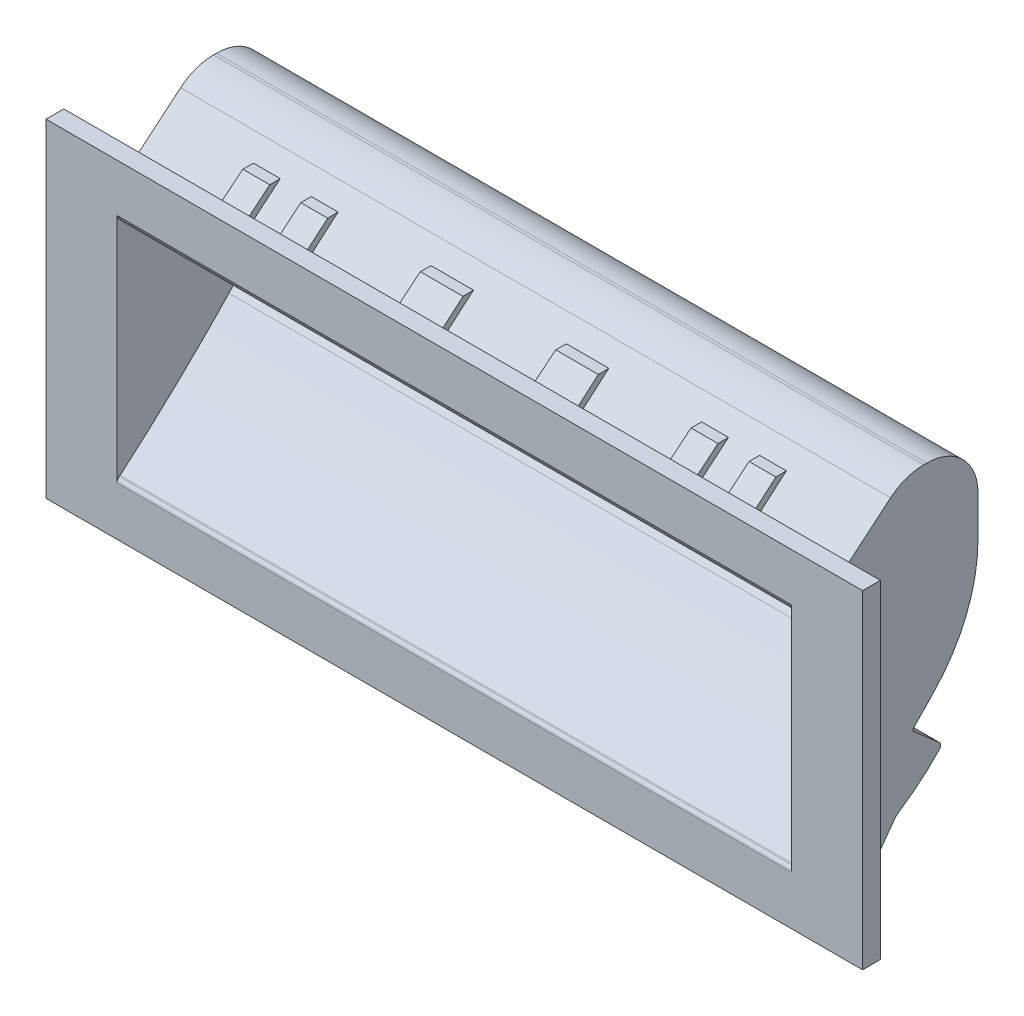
ISO-10303-21;
HEADER;
FILE_DESCRIPTION(('STEP AP214'),'2;1');
FILE_NAME('part.step','',(''),(''),'','','');
FILE_SCHEMA(('AUTOMOTIVE_DESIGN { 1 0 10303 214 1 1 1 1 }'));
ENDSEC;
DATA;
#1=APPLICATION_CONTEXT('core data for automotive mechanical design processes');
#2=APPLICATION_PROTOCOL_DEFINITION('international standard','automotive_design',2000,#1);
#3=PRODUCT_CONTEXT('',#1,'mechanical');
#4=PRODUCT('Part','Part','',(#3));
#5=PRODUCT_RELATED_PRODUCT_CATEGORY('part','',(#4));
#6=PRODUCT_DEFINITION_FORMATION('','',#4);
#7=PRODUCT_DEFINITION_CONTEXT('part definition',#1,'design');
#8=PRODUCT_DEFINITION('design','',#6,#7);
#9=PRODUCT_DEFINITION_SHAPE('','',#8);
#10=(LENGTH_UNIT() NAMED_UNIT(*) SI_UNIT(.MILLI.,.METRE.));
#11=(NAMED_UNIT(*) PLANE_ANGLE_UNIT() SI_UNIT($,.RADIAN.));
#12=(NAMED_UNIT(*) SI_UNIT($,.STERADIAN.) SOLID_ANGLE_UNIT());
#13=UNCERTAINTY_MEASURE_WITH_UNIT(LENGTH_MEASURE(1.E-05),#10,'distance_accuracy_value','');
#14=(GEOMETRIC_REPRESENTATION_CONTEXT(3) GLOBAL_UNCERTAINTY_ASSIGNED_CONTEXT((#13)) GLOBAL_UNIT_ASSIGNED_CONTEXT((#10,
#11,#12)) REPRESENTATION_CONTEXT('',''));
#15=CARTESIAN_POINT('',(0.,0.,0.));
#16=DIRECTION('',(0.,0.,1.));
#17=DIRECTION('',(1.,0.,0.));
#18=AXIS2_PLACEMENT_3D('',#15,#16,#17);
#19=CARTESIAN_POINT('',(40.,0.0539883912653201,-1.13094022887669));
#20=DIRECTION('',(1.,0.,0.));
#21=DIRECTION('',(0.,0.,-1.));
#22=AXIS2_PLACEMENT_3D('',#19,#20,#21);
#23=CYLINDRICAL_SURFACE('',#22,0.501000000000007);
#24=CARTESIAN_POINT('',(40.,0.0539883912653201,-1.13094022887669));
#25=DIRECTION('',(1.,0.,0.));
#26=DIRECTION('',(0.,0.,-1.));
#27=AXIS2_PLACEMENT_3D('',#24,#25,#26);
#28=CIRCLE('',#27,0.501000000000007);
#29=CARTESIAN_POINT('',(40.,-0.342750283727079,-0.824999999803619));
#30=VERTEX_POINT('',#29);
#31=CARTESIAN_POINT('',(40.,0.0462497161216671,-0.63));
#32=VERTEX_POINT('',#31);
#33=EDGE_CURVE('E389',#30,#32,#28,.F.);
#34=ORIENTED_EDGE('',*,*,#33,.T.);
#35=DIRECTION('',(1.,0.,0.));
#36=VECTOR('',#35,1.);
#37=CARTESIAN_POINT('',(40.,0.0462497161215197,-0.63));
#38=LINE('',#37,#36);
#39=CARTESIAN_POINT('',(-40.,0.0462497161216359,-0.63));
#40=VERTEX_POINT('',#39);
#41=EDGE_CURVE('E391',#40,#32,#38,.T.);
#42=ORIENTED_EDGE('',*,*,#41,.F.);
#43=CARTESIAN_POINT('',(-40.,0.0539883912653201,-1.13094022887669));
#44=DIRECTION('',(1.,0.,0.));
#45=DIRECTION('',(0.,0.,-1.));
#46=AXIS2_PLACEMENT_3D('',#43,#44,#45);
#47=CIRCLE('',#46,0.501000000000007);
#48=CARTESIAN_POINT('',(-40.,-0.342750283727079,-0.824999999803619));
#49=VERTEX_POINT('',#48);
#50=EDGE_CURVE('E17',#40,#49,#47,.T.);
#51=ORIENTED_EDGE('',*,*,#50,.T.);
#52=DIRECTION('',(1.,0.,0.));
#53=VECTOR('',#52,1.);
#54=CARTESIAN_POINT('',(40.,-0.342750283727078,-0.824999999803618));
#55=LINE('',#54,#53);
#56=EDGE_CURVE('E712',#30,#49,#55,.F.);
#57=ORIENTED_EDGE('',*,*,#56,.F.);
#58=EDGE_LOOP('',(#34,#42,#51,#57));
#59=FACE_BOUND('',#58,.T.);
#60=ADVANCED_FACE('F14',(#59),#23,.T.);
#61=CARTESIAN_POINT('',(40.,-1.20135396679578,-3.97585910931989));
#62=DIRECTION('',(1.,0.,0.));
#63=DIRECTION('',(0.,0.,-1.));
#64=AXIS2_PLACEMENT_3D('',#61,#62,#63);
#65=CYLINDRICAL_SURFACE('',#64,0.499998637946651);
#66=CARTESIAN_POINT('',(40.,-1.20135396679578,-3.97585910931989));
#67=DIRECTION('',(1.,0.,0.));
#68=DIRECTION('',(0.,0.,-1.));
#69=AXIS2_PLACEMENT_3D('',#66,#67,#68);
#70=CIRCLE('',#69,0.499998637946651);
#71=CARTESIAN_POINT('',(40.,-1.49522987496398,-4.38037806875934));
#72=VERTEX_POINT('',#71);
#73=CARTESIAN_POINT('',(40.,-1.69375028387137,-3.88899999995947));
#74=VERTEX_POINT('',#73);
#75=EDGE_CURVE('E518',#72,#74,#70,.F.);
#76=ORIENTED_EDGE('',*,*,#75,.T.);
#77=DIRECTION('',(1.,0.,0.));
#78=VECTOR('',#77,1.);
#79=CARTESIAN_POINT('',(40.,-1.69375028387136,-3.88899999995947));
#80=LINE('',#79,#78);
#81=CARTESIAN_POINT('',(-40.,-1.69375028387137,-3.88899999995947));
#82=VERTEX_POINT('',#81);
#83=EDGE_CURVE('E394',#82,#74,#80,.T.);
#84=ORIENTED_EDGE('',*,*,#83,.F.);
#85=CARTESIAN_POINT('',(-40.,-1.20135396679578,-3.97585910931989));
#86=DIRECTION('',(1.,0.,0.));
#87=DIRECTION('',(0.,0.,-1.));
#88=AXIS2_PLACEMENT_3D('',#85,#86,#87);
#89=CIRCLE('',#88,0.499998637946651);
#90=CARTESIAN_POINT('',(-40.,-1.49522987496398,-4.38037806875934));
#91=VERTEX_POINT('',#90);
#92=EDGE_CURVE('E520',#82,#91,#89,.T.);
#93=ORIENTED_EDGE('',*,*,#92,.T.);
#94=DIRECTION('',(1.,0.,0.));
#95=VECTOR('',#94,1.);
#96=CARTESIAN_POINT('',(40.,-1.49522944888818,-4.3803783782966));
#97=LINE('',#96,#95);
#98=EDGE_CURVE('E526',#72,#91,#97,.F.);
#99=ORIENTED_EDGE('',*,*,#98,.F.);
#100=EDGE_LOOP('',(#76,#84,#93,#99));
#101=FACE_BOUND('',#100,.T.);
#102=ADVANCED_FACE('F525',(#101),#65,.T.);
#103=CARTESIAN_POINT('',(40.,1.70881342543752,-9.1801314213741));
#104=DIRECTION('',(1.,0.,0.));
#105=DIRECTION('',(0.,0.,-1.));
#106=AXIS2_PLACEMENT_3D('',#103,#104,#105);
#107=CYLINDRICAL_SURFACE('',#106,1.99999994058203);
#108=DIRECTION('',(1.,0.,0.));
#109=VECTOR('',#108,1.);
#110=CARTESIAN_POINT('',(40.,3.38624971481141,-8.09099999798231));
#111=LINE('',#110,#109);
#112=CARTESIAN_POINT('',(40.,3.38624971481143,-8.09099999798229));
#113=VERTEX_POINT('',#112);
#114=CARTESIAN_POINT('',(-40.,3.38624971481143,-8.09099999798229));
#115=VERTEX_POINT('',#114);
#116=EDGE_CURVE('E706',#113,#115,#111,.F.);
#117=ORIENTED_EDGE('',*,*,#116,.F.);
#118=CARTESIAN_POINT('',(40.,1.70881342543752,-9.1801314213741));
#119=DIRECTION('',(1.,0.,0.));
#120=DIRECTION('',(0.,0.,-1.));
#121=AXIS2_PLACEMENT_3D('',#118,#119,#120);
#122=CIRCLE('',#121,1.99999994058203);
#123=CARTESIAN_POINT('',(40.,2.88432192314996,-7.56205245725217));
#124=VERTEX_POINT('',#123);
#125=EDGE_CURVE('E516',#124,#113,#122,.F.);
#126=ORIENTED_EDGE('',*,*,#125,.F.);
#127=DIRECTION('',(1.,0.,0.));
#128=VECTOR('',#127,1.);
#129=CARTESIAN_POINT('',(40.,2.88432191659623,-7.56205245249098));
#130=LINE('',#129,#128);
#131=CARTESIAN_POINT('',(-40.,2.88432192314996,-7.56205245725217));
#132=VERTEX_POINT('',#131);
#133=EDGE_CURVE('E536',#132,#124,#130,.T.);
#134=ORIENTED_EDGE('',*,*,#133,.F.);
#135=CARTESIAN_POINT('',(-40.,1.70881342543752,-9.1801314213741));
#136=DIRECTION('',(1.,0.,0.));
#137=DIRECTION('',(0.,0.,-1.));
#138=AXIS2_PLACEMENT_3D('',#135,#136,#137);
#139=CIRCLE('',#138,1.99999994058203);
#140=EDGE_CURVE('E514',#115,#132,#139,.T.);
#141=ORIENTED_EDGE('',*,*,#140,.F.);
#142=EDGE_LOOP('',(#117,#126,#134,#141));
#143=FACE_BOUND('',#142,.T.);
#144=ADVANCED_FACE('F1104',(#143),#107,.F.);
#145=CARTESIAN_POINT('',(40.,7.54991593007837,-12.2879463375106));
#146=DIRECTION('',(1.,0.,0.));
#147=DIRECTION('',(0.,0.,-1.));
#148=AXIS2_PLACEMENT_3D('',#145,#146,#147);
#149=CYLINDRICAL_SURFACE('',#148,0.499999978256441);
#150=CARTESIAN_POINT('',(40.,7.54991593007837,-12.2879463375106));
#151=DIRECTION('',(1.,0.,0.));
#152=DIRECTION('',(0.,0.,-1.));
#153=AXIS2_PLACEMENT_3D('',#150,#151,#152);
#154=CIRCLE('',#153,0.499999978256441);
#155=CARTESIAN_POINT('',(40.,7.92732538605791,-12.6159129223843));
#156=VERTEX_POINT('',#155);
#157=CARTESIAN_POINT('',(40.,7.20824971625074,-12.6530000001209));
#158=VERTEX_POINT('',#157);
#159=EDGE_CURVE('E510',#156,#158,#154,.F.);
#160=ORIENTED_EDGE('',*,*,#159,.T.);
#161=DIRECTION('',(1.,0.,0.));
#162=VECTOR('',#161,1.);
#163=CARTESIAN_POINT('',(40.,7.20824971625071,-12.6530000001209));
#164=LINE('',#163,#162);
#165=CARTESIAN_POINT('',(-40.,7.20824971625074,-12.6530000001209));
#166=VERTEX_POINT('',#165);
#167=EDGE_CURVE('E535',#166,#158,#164,.T.);
#168=ORIENTED_EDGE('',*,*,#167,.F.);
#169=CARTESIAN_POINT('',(-40.,7.54991593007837,-12.2879463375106));
#170=DIRECTION('',(1.,0.,0.));
#171=DIRECTION('',(0.,0.,-1.));
#172=AXIS2_PLACEMENT_3D('',#169,#170,#171);
#173=CIRCLE('',#172,0.499999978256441);
#174=CARTESIAN_POINT('',(-40.,7.92732538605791,-12.6159129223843));
#175=VERTEX_POINT('',#174);
#176=EDGE_CURVE('E512',#166,#175,#173,.T.);
#177=ORIENTED_EDGE('',*,*,#176,.T.);
#178=DIRECTION('',(1.,0.,0.));
#179=VECTOR('',#178,1.);
#180=CARTESIAN_POINT('',(40.,7.92732539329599,-12.615912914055));
#181=LINE('',#180,#179);
#182=EDGE_CURVE('E700',#156,#175,#181,.F.);
#183=ORIENTED_EDGE('',*,*,#182,.F.);
#184=EDGE_LOOP('',(#160,#168,#177,#183));
#185=FACE_BOUND('',#184,.T.);
#186=ADVANCED_FACE('F1100',(#185),#149,.T.);
#187=CARTESIAN_POINT('',(40.,10.5923912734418,-9.8539816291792));
#188=DIRECTION('',(1.,0.,0.));
#189=DIRECTION('',(0.,0.,-1.));
#190=AXIS2_PLACEMENT_3D('',#187,#188,#189);
#191=CYLINDRICAL_SURFACE('',#190,0.199999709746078);
#192=DIRECTION('',(1.,0.,0.));
#193=VECTOR('',#192,1.);
#194=CARTESIAN_POINT('',(40.,10.7332497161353,-9.71200000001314));
#195=LINE('',#194,#193);
#196=CARTESIAN_POINT('',(40.,10.7332497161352,-9.71200000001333));
#197=VERTEX_POINT('',#196);
#198=CARTESIAN_POINT('',(-40.,10.7332497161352,-9.71200000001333));
#199=VERTEX_POINT('',#198);
#200=EDGE_CURVE('E697',#197,#199,#195,.F.);
#201=ORIENTED_EDGE('',*,*,#200,.F.);
#202=CARTESIAN_POINT('',(40.,10.5923912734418,-9.8539816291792));
#203=DIRECTION('',(1.,0.,0.));
#204=DIRECTION('',(0.,0.,-1.));
#205=AXIS2_PLACEMENT_3D('',#202,#203,#204);
#206=CIRCLE('',#205,0.199999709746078);
#207=CARTESIAN_POINT('',(40.,10.4414276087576,-9.72279528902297));
#208=VERTEX_POINT('',#207);
#209=EDGE_CURVE('E508',#208,#197,#206,.F.);
#210=ORIENTED_EDGE('',*,*,#209,.F.);
#211=DIRECTION('',(1.,0.,0.));
#212=VECTOR('',#211,1.);
#213=CARTESIAN_POINT('',(40.,10.4414275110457,-9.7227954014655));
#214=LINE('',#213,#212);
#215=CARTESIAN_POINT('',(-40.,10.4414276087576,-9.72279528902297));
#216=VERTEX_POINT('',#215);
#217=EDGE_CURVE('E703',#216,#208,#214,.T.);
#218=ORIENTED_EDGE('',*,*,#217,.F.);
#219=CARTESIAN_POINT('',(-40.,10.5923912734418,-9.8539816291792));
#220=DIRECTION('',(1.,0.,0.));
#221=DIRECTION('',(0.,0.,-1.));
#222=AXIS2_PLACEMENT_3D('',#219,#220,#221);
#223=CIRCLE('',#222,0.199999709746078);
#224=EDGE_CURVE('E408',#199,#216,#223,.T.);
#225=ORIENTED_EDGE('',*,*,#224,.F.);
#226=EDGE_LOOP('',(#201,#210,#218,#225));
#227=FACE_BOUND('',#226,.T.);
#228=ADVANCED_FACE('F1097',(#227),#191,.F.);
#229=CARTESIAN_POINT('',(40.,35.8672497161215,-11.203));
#230=DIRECTION('',(0.,1.,0.));
#231=DIRECTION('',(0.,0.,1.));
#232=AXIS2_PLACEMENT_3D('',#229,#230,#231);
#233=PLANE('',#232);
#234=DIRECTION('',(0.,0.,1.));
#235=VECTOR('',#234,1.);
#236=CARTESIAN_POINT('',(40.,35.8672497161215,-11.203));
#237=LINE('',#236,#235);
#238=CARTESIAN_POINT('',(40.,35.8672497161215,-10.8856009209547));
#239=VERTEX_POINT('',#238);
#240=CARTESIAN_POINT('',(40.,35.8672497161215,-11.2030000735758));
#241=VERTEX_POINT('',#240);
#242=EDGE_CURVE('E400',#239,#241,#237,.F.);
#243=ORIENTED_EDGE('',*,*,#242,.T.);
#244=DIRECTION('',(1.,0.,0.));
#245=VECTOR('',#244,1.);
#246=CARTESIAN_POINT('',(40.,35.8672497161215,-11.203));
#247=LINE('',#246,#245);
#248=CARTESIAN_POINT('',(-40.,35.8672497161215,-11.2030000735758));
#249=VERTEX_POINT('',#248);
#250=EDGE_CURVE('E688',#249,#241,#247,.T.);
#251=ORIENTED_EDGE('',*,*,#250,.F.);
#252=DIRECTION('',(0.,0.,1.));
#253=VECTOR('',#252,1.);
#254=CARTESIAN_POINT('',(-40.,35.8672497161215,-11.203));
#255=LINE('',#254,#253);
#256=CARTESIAN_POINT('',(-40.,35.8672497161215,-10.8856009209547));
#257=VERTEX_POINT('',#256);
#258=EDGE_CURVE('E402',#249,#257,#255,.T.);
#259=ORIENTED_EDGE('',*,*,#258,.T.);
#260=DIRECTION('',(1.,0.,0.));
#261=VECTOR('',#260,1.);
#262=CARTESIAN_POINT('',(40.,35.8672497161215,-10.8856009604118));
#263=LINE('',#262,#261);
#264=EDGE_CURVE('E633',#239,#257,#263,.F.);
#265=ORIENTED_EDGE('',*,*,#264,.F.);
#266=EDGE_LOOP('',(#243,#251,#259,#265));
#267=FACE_BOUND('',#266,.T.);
#268=ADVANCED_FACE('F743',(#267),#233,.T.);
#269=CARTESIAN_POINT('',(40.,0.14724971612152,-0.63));
#270=DIRECTION('',(0.,0.,1.));
#271=DIRECTION('',(0.,-1.,0.));
#272=AXIS2_PLACEMENT_3D('',#269,#270,#271);
#273=PLANE('',#272);
#274=DIRECTION('',(0.,1.,0.));
#275=VECTOR('',#274,1.);
#276=CARTESIAN_POINT('',(40.,14.5322497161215,-0.63));
#277=LINE('',#276,#275);
#278=CARTESIAN_POINT('',(40.,0.147249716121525,-0.63));
#279=VERTEX_POINT('',#278);
#280=EDGE_CURVE('E423',#279,#32,#277,.F.);
#281=ORIENTED_EDGE('',*,*,#280,.F.);
#282=DIRECTION('',(1.,0.,0.));
#283=VECTOR('',#282,1.);
#284=CARTESIAN_POINT('',(40.,0.147249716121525,-0.63));
#285=LINE('',#284,#283);
#286=CARTESIAN_POINT('',(-40.,0.147249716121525,-0.63));
#287=VERTEX_POINT('',#286);
#288=EDGE_CURVE('E398',#287,#279,#285,.T.);
#289=ORIENTED_EDGE('',*,*,#288,.F.);
#290=DIRECTION('',(0.,-1.,0.));
#291=VECTOR('',#290,1.);
#292=CARTESIAN_POINT('',(-40.,0.14724971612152,-0.63));
#293=LINE('',#292,#291);
#294=EDGE_CURVE('E382',#287,#40,#293,.T.);
#295=ORIENTED_EDGE('',*,*,#294,.T.);
#296=ORIENTED_EDGE('',*,*,#41,.T.);
#297=EDGE_LOOP('',(#281,#289,#295,#296));
#298=FACE_BOUND('',#297,.T.);
#299=ADVANCED_FACE('F396',(#298),#273,.T.);
#300=CARTESIAN_POINT('',(40.,5.201790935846,-5.09958344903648));
#301=DIRECTION('',(1.,0.,0.));
#302=DIRECTION('',(0.,0.,-1.));
#303=AXIS2_PLACEMENT_3D('',#300,#301,#302);
#304=CYLINDRICAL_SURFACE('',#303,7.001);
#305=CARTESIAN_POINT('',(40.,5.201790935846,-5.09958344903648));
#306=DIRECTION('',(1.,0.,0.));
#307=DIRECTION('',(0.,0.,-1.));
#308=AXIS2_PLACEMENT_3D('',#305,#306,#307);
#309=CIRCLE('',#308,7.001);
#310=EDGE_CURVE('E504',#30,#74,#309,.T.);
#311=ORIENTED_EDGE('',*,*,#310,.F.);
#312=ORIENTED_EDGE('',*,*,#56,.T.);
#313=CARTESIAN_POINT('',(-40.,5.201790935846,-5.09958344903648));
#314=DIRECTION('',(1.,0.,0.));
#315=DIRECTION('',(0.,0.,-1.));
#316=AXIS2_PLACEMENT_3D('',#313,#314,#315);
#317=CIRCLE('',#316,7.001);
#318=EDGE_CURVE('E385',#49,#82,#317,.T.);
#319=ORIENTED_EDGE('',*,*,#318,.T.);
#320=ORIENTED_EDGE('',*,*,#83,.T.);
#321=EDGE_LOOP('',(#311,#312,#319,#320));
#322=FACE_BOUND('',#321,.T.);
#323=ADVANCED_FACE('F715',(#322),#304,.T.);
#324=CARTESIAN_POINT('',(40.,-1.49522944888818,-4.3803783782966));
#325=DIRECTION('',(0.,-0.587754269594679,-0.80903950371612));
#326=DIRECTION('',(0.,0.80903950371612,-0.587754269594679));
#327=AXIS2_PLACEMENT_3D('',#324,#325,#326);
#328=PLANE('',#327);
#329=DIRECTION('',(0.,0.809039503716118,-0.587754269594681));
#330=VECTOR('',#329,1.);
#331=CARTESIAN_POINT('',(40.,-1.49522944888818,-4.3803783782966));
#332=LINE('',#331,#330);
#333=EDGE_CURVE('E503',#72,#124,#332,.T.);
#334=ORIENTED_EDGE('',*,*,#333,.F.);
#335=ORIENTED_EDGE('',*,*,#98,.T.);
#336=DIRECTION('',(0.,0.809039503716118,-0.587754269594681));
#337=VECTOR('',#336,1.);
#338=CARTESIAN_POINT('',(-40.,-1.49522944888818,-4.3803783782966));
#339=LINE('',#338,#337);
#340=EDGE_CURVE('E480',#91,#132,#339,.T.);
#341=ORIENTED_EDGE('',*,*,#340,.T.);
#342=ORIENTED_EDGE('',*,*,#133,.T.);
#343=EDGE_LOOP('',(#334,#335,#341,#342));
#344=FACE_BOUND('',#343,.T.);
#345=ADVANCED_FACE('F532',(#344),#328,.T.);
#346=CARTESIAN_POINT('',(40.,23.9808757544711,5.28096333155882));
#347=DIRECTION('',(1.,0.,0.));
#348=DIRECTION('',(0.,0.,-1.));
#349=AXIS2_PLACEMENT_3D('',#346,#347,#348);
#350=CYLINDRICAL_SURFACE('',#349,24.5550000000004);
#351=CARTESIAN_POINT('',(40.,23.9808757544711,5.28096333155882));
#352=DIRECTION('',(1.,0.,0.));
#353=DIRECTION('',(0.,0.,-1.));
#354=AXIS2_PLACEMENT_3D('',#351,#352,#353);
#355=CIRCLE('',#354,24.5550000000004);
#356=EDGE_CURVE('E500',#113,#158,#355,.T.);
#357=ORIENTED_EDGE('',*,*,#356,.F.);
#358=ORIENTED_EDGE('',*,*,#116,.T.);
#359=CARTESIAN_POINT('',(-40.,23.9808757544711,5.28096333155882));
#360=DIRECTION('',(1.,0.,0.));
#361=DIRECTION('',(0.,0.,-1.));
#362=AXIS2_PLACEMENT_3D('',#359,#360,#361);
#363=CIRCLE('',#362,24.5550000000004);
#364=EDGE_CURVE('E477',#115,#166,#363,.T.);
#365=ORIENTED_EDGE('',*,*,#364,.T.);
#366=ORIENTED_EDGE('',*,*,#167,.T.);
#367=EDGE_LOOP('',(#357,#358,#365,#366));
#368=FACE_BOUND('',#367,.T.);
#369=ADVANCED_FACE('F1084',(#368),#350,.T.);
#370=CARTESIAN_POINT('',(40.,7.92732539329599,-12.615912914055));
#371=DIRECTION('',(0.,0.754818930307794,-0.655933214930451));
#372=DIRECTION('',(0.,0.655933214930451,0.754818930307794));
#373=AXIS2_PLACEMENT_3D('',#370,#371,#372);
#374=PLANE('',#373);
#375=DIRECTION('',(0.,0.655933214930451,0.754818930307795));
#376=VECTOR('',#375,1.);
#377=CARTESIAN_POINT('',(40.,7.92732539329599,-12.615912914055));
#378=LINE('',#377,#376);
#379=EDGE_CURVE('E499',#156,#208,#378,.T.);
#380=ORIENTED_EDGE('',*,*,#379,.F.);
#381=ORIENTED_EDGE('',*,*,#182,.T.);
#382=DIRECTION('',(0.,0.655933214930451,0.754818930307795));
#383=VECTOR('',#382,1.);
#384=CARTESIAN_POINT('',(-40.,7.92732539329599,-12.615912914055));
#385=LINE('',#384,#383);
#386=EDGE_CURVE('E476',#175,#216,#385,.T.);
#387=ORIENTED_EDGE('',*,*,#386,.T.);
#388=ORIENTED_EDGE('',*,*,#217,.T.);
#389=EDGE_LOOP('',(#380,#381,#387,#388));
#390=FACE_BOUND('',#389,.T.);
#391=ADVANCED_FACE('F1080',(#390),#374,.T.);
#392=CARTESIAN_POINT('',(40.,124.63211254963,105.530222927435));
#393=DIRECTION('',(1.,0.,0.));
#394=DIRECTION('',(0.,0.,-1.));
#395=AXIS2_PLACEMENT_3D('',#392,#393,#394);
#396=CYLINDRICAL_SURFACE('',#395,162.030000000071);
#397=CARTESIAN_POINT('',(40.,124.63211254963,105.530222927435));
#398=DIRECTION('',(1.,0.,0.));
#399=DIRECTION('',(0.,0.,-1.));
#400=AXIS2_PLACEMENT_3D('',#397,#398,#399);
#401=CIRCLE('',#400,162.030000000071);
#402=CARTESIAN_POINT('',(40.,13.1642497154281,-12.0649999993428));
#403=VERTEX_POINT('',#402);
#404=EDGE_CURVE('E496',#197,#403,#401,.T.);
#405=ORIENTED_EDGE('',*,*,#404,.F.);
#406=ORIENTED_EDGE('',*,*,#200,.T.);
#407=CARTESIAN_POINT('',(-40.,124.63211254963,105.530222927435));
#408=DIRECTION('',(1.,0.,0.));
#409=DIRECTION('',(0.,0.,-1.));
#410=AXIS2_PLACEMENT_3D('',#407,#408,#409);
#411=CIRCLE('',#410,162.030000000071);
#412=CARTESIAN_POINT('',(-40.,13.1642497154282,-12.0649999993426));
#413=VERTEX_POINT('',#412);
#414=EDGE_CURVE('E474',#199,#413,#411,.T.);
#415=ORIENTED_EDGE('',*,*,#414,.T.);
#416=DIRECTION('',(1.,0.,0.));
#417=VECTOR('',#416,1.);
#418=CARTESIAN_POINT('',(40.,13.1642497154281,-12.0649999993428));
#419=LINE('',#418,#417);
#420=EDGE_CURVE('E694',#403,#413,#419,.F.);
#421=ORIENTED_EDGE('',*,*,#420,.F.);
#422=EDGE_LOOP('',(#405,#406,#415,#421));
#423=FACE_BOUND('',#422,.T.);
#424=ADVANCED_FACE('F1076',(#423),#396,.T.);
#425=CARTESIAN_POINT('',(40.,25.551336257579,0.9989999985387));
#426=DIRECTION('',(1.,0.,0.));
#427=DIRECTION('',(0.,0.,-1.));
#428=AXIS2_PLACEMENT_3D('',#425,#426,#427);
#429=CYLINDRICAL_SURFACE('',#428,18.0029999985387);
#430=CARTESIAN_POINT('',(40.,25.551336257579,0.9989999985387));
#431=DIRECTION('',(1.,0.,0.));
#432=DIRECTION('',(0.,0.,-1.));
#433=AXIS2_PLACEMENT_3D('',#430,#431,#432);
#434=CIRCLE('',#433,18.0029999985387);
#435=CARTESIAN_POINT('',(40.,25.5513362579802,-17.004));
#436=VERTEX_POINT('',#435);
#437=EDGE_CURVE('E493',#403,#436,#434,.T.);
#438=ORIENTED_EDGE('',*,*,#437,.F.);
#439=ORIENTED_EDGE('',*,*,#420,.T.);
#440=CARTESIAN_POINT('',(-40.,25.551336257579,0.9989999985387));
#441=DIRECTION('',(1.,0.,0.));
#442=DIRECTION('',(0.,0.,-1.));
#443=AXIS2_PLACEMENT_3D('',#440,#441,#442);
#444=CIRCLE('',#443,18.0029999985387);
#445=CARTESIAN_POINT('',(-40.,25.5513362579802,-17.004));
#446=VERTEX_POINT('',#445);
#447=EDGE_CURVE('E472',#413,#446,#444,.T.);
#448=ORIENTED_EDGE('',*,*,#447,.T.);
#449=DIRECTION('',(-1.,0.,0.));
#450=VECTOR('',#449,1.);
#451=CARTESIAN_POINT('',(40.,25.5513362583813,-17.004));
#452=LINE('',#451,#450);
#453=EDGE_CURVE('E691',#436,#446,#452,.T.);
#454=ORIENTED_EDGE('',*,*,#453,.F.);
#455=EDGE_LOOP('',(#438,#439,#448,#454));
#456=FACE_BOUND('',#455,.T.);
#457=ADVANCED_FACE('F1073',(#456),#429,.T.);
#458=CARTESIAN_POINT('',(40.,25.5513362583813,-17.004));
#459=DIRECTION('',(0.,0.,-1.));
#460=DIRECTION('',(-1.,0.,0.));
#461=AXIS2_PLACEMENT_3D('',#458,#459,#460);
#462=PLANE('',#461);
#463=DIRECTION('',(0.,1.,0.));
#464=VECTOR('',#463,1.);
#465=CARTESIAN_POINT('',(40.,14.5322497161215,-17.004));
#466=LINE('',#465,#464);
#467=CARTESIAN_POINT('',(40.,30.0662498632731,-17.004));
#468=VERTEX_POINT('',#467);
#469=EDGE_CURVE('E492',#436,#468,#466,.T.);
#470=ORIENTED_EDGE('',*,*,#469,.F.);
#471=ORIENTED_EDGE('',*,*,#453,.T.);
#472=DIRECTION('',(0.,1.,0.));
#473=VECTOR('',#472,1.);
#474=CARTESIAN_POINT('',(-40.,14.5322497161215,-17.004));
#475=LINE('',#474,#473);
#476=CARTESIAN_POINT('',(-40.,30.0662498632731,-17.004));
#477=VERTEX_POINT('',#476);
#478=EDGE_CURVE('E471',#446,#477,#475,.T.);
#479=ORIENTED_EDGE('',*,*,#478,.T.);
#480=DIRECTION('',(1.,0.,0.));
#481=VECTOR('',#480,1.);
#482=CARTESIAN_POINT('',(40.,30.0662498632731,-17.004));
#483=LINE('',#482,#481);
#484=EDGE_CURVE('E683',#468,#477,#483,.F.);
#485=ORIENTED_EDGE('',*,*,#484,.F.);
#486=EDGE_LOOP('',(#470,#471,#479,#485));
#487=FACE_BOUND('',#486,.T.);
#488=ADVANCED_FACE('F1070',(#487),#462,.T.);
#489=CARTESIAN_POINT('',(40.,30.0662498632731,-11.2030001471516));
#490=DIRECTION('',(1.,0.,0.));
#491=DIRECTION('',(0.,0.,-1.));
#492=AXIS2_PLACEMENT_3D('',#489,#490,#491);
#493=CYLINDRICAL_SURFACE('',#492,5.80099985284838);
#494=CARTESIAN_POINT('',(40.,30.0662498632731,-11.2030001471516));
#495=DIRECTION('',(1.,0.,0.));
#496=DIRECTION('',(0.,0.,-1.));
#497=AXIS2_PLACEMENT_3D('',#494,#495,#496);
#498=CIRCLE('',#497,5.80099985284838);
#499=EDGE_CURVE('E489',#468,#241,#498,.T.);
#500=ORIENTED_EDGE('',*,*,#499,.F.);
#501=ORIENTED_EDGE('',*,*,#484,.T.);
#502=CARTESIAN_POINT('',(-40.,30.0662498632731,-11.2030001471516));
#503=DIRECTION('',(1.,0.,0.));
#504=DIRECTION('',(0.,0.,-1.));
#505=AXIS2_PLACEMENT_3D('',#502,#503,#504);
#506=CIRCLE('',#505,5.80099985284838);
#507=EDGE_CURVE('E468',#477,#249,#506,.T.);
#508=ORIENTED_EDGE('',*,*,#507,.T.);
#509=ORIENTED_EDGE('',*,*,#250,.T.);
#510=EDGE_LOOP('',(#500,#501,#508,#509));
#511=FACE_BOUND('',#510,.T.);
#512=ADVANCED_FACE('F746',(#511),#493,.T.);
#513=CARTESIAN_POINT('',(-20.5541121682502,14.5322497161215,-11.5749870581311));
#514=DIRECTION('',(0.999935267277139,0.,-0.0113781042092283));
#515=DIRECTION('',(-0.0113781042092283,0.,-0.999935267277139));
#516=AXIS2_PLACEMENT_3D('',#513,#514,#515);
#517=PLANE('',#516);
#518=DIRECTION('',(0.00871619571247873,-0.642781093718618,0.766000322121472));
#519=VECTOR('',#518,1.);
#520=CARTESIAN_POINT('',(-20.4837987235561,33.0322497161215,-5.39567178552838));
#521=LINE('',#520,#519);
#522=CARTESIAN_POINT('',(-20.4837987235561,33.0322497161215,-5.39567178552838));
#523=VERTEX_POINT('',#522);
#524=CARTESIAN_POINT('',(-20.4224022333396,28.504528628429,0.));
#525=VERTEX_POINT('',#524);
#526=EDGE_CURVE('E467',#523,#525,#521,.T.);
#527=ORIENTED_EDGE('',*,*,#526,.F.);
#528=DIRECTION('',(-0.0113781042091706,0.,-0.99993526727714));
#529=VECTOR('',#528,1.);
#530=CARTESIAN_POINT('',(-20.470238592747,33.0322497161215,-4.20397475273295));
#531=LINE('',#530,#529);
#532=CARTESIAN_POINT('',(-20.470238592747,33.0322497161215,-4.20397475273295));
#533=VERTEX_POINT('',#532);
#534=EDGE_CURVE('E619',#533,#523,#531,.T.);
#535=ORIENTED_EDGE('',*,*,#534,.F.);
#536=DIRECTION('',(0.00871619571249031,-0.642781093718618,0.766000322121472));
#537=VECTOR('',#536,1.);
#538=CARTESIAN_POINT('',(-20.470238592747,33.0322497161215,-4.20397475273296));
#539=LINE('',#538,#537);
#540=CARTESIAN_POINT('',(-20.4224022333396,29.504528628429,0.));
#541=VERTEX_POINT('',#540);
#542=EDGE_CURVE('E599',#533,#541,#539,.T.);
#543=ORIENTED_EDGE('',*,*,#542,.T.);
#544=DIRECTION('',(0.,1.,0.));
#545=VECTOR('',#544,1.);
#546=CARTESIAN_POINT('',(-20.4224022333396,14.5322497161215,0.));
#547=LINE('',#546,#545);
#548=EDGE_CURVE('E681',#541,#525,#547,.F.);
#549=ORIENTED_EDGE('',*,*,#548,.T.);
#550=EDGE_LOOP('',(#527,#535,#543,#549));
#551=FACE_BOUND('',#550,.T.);
#552=ADVANCED_FACE('F1063',(#551),#517,.T.);
#553=CARTESIAN_POINT('',(-10.0761750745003,14.5322497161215,0.));
#554=DIRECTION('',(-0.999935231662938,0.,-0.0113812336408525));
#555=DIRECTION('',(-0.0113812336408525,0.,0.999935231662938));
#556=AXIS2_PLACEMENT_3D('',#553,#554,#555);
#557=PLANE('',#556);
#558=DIRECTION('',(0.0087185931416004,0.6427810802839,-0.766000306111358));
#559=VECTOR('',#558,1.);
#560=CARTESIAN_POINT('',(-10.0761750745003,28.504528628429,0.));
#561=LINE('',#560,#559);
#562=CARTESIAN_POINT('',(-10.0761750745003,28.504528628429,0.));
#563=VERTEX_POINT('',#562);
#564=CARTESIAN_POINT('',(-10.0147616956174,33.0322497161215,-5.39567178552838));
#565=VERTEX_POINT('',#564);
#566=EDGE_CURVE('E754',#563,#565,#561,.T.);
#567=ORIENTED_EDGE('',*,*,#566,.F.);
#568=DIRECTION('',(0.,1.,0.));
#569=VECTOR('',#568,1.);
#570=CARTESIAN_POINT('',(-10.0761750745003,14.5322497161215,0.));
#571=LINE('',#570,#569);
#572=CARTESIAN_POINT('',(-10.0761750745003,29.504528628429,0.));
#573=VERTEX_POINT('',#572);
#574=EDGE_CURVE('E679',#563,#573,#571,.T.);
#575=ORIENTED_EDGE('',*,*,#574,.T.);
#576=DIRECTION('',(0.00871859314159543,0.6427810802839,-0.766000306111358));
#577=VECTOR('',#576,1.);
#578=CARTESIAN_POINT('',(-10.0761750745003,29.504528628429,0.));
#579=LINE('',#578,#577);
#580=CARTESIAN_POINT('',(-10.0283255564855,33.0322497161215,-4.20397475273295));
#581=VERTEX_POINT('',#580);
#582=EDGE_CURVE('E588',#573,#581,#579,.T.);
#583=ORIENTED_EDGE('',*,*,#582,.T.);
#584=DIRECTION('',(-0.0113812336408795,0.,0.999935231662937));
#585=VECTOR('',#584,1.);
#586=CARTESIAN_POINT('',(-10.0147616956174,33.0322497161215,-5.39567178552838));
#587=LINE('',#586,#585);
#588=EDGE_CURVE('E677',#565,#581,#587,.T.);
#589=ORIENTED_EDGE('',*,*,#588,.F.);
#590=EDGE_LOOP('',(#567,#575,#583,#589));
#591=FACE_BOUND('',#590,.T.);
#592=ADVANCED_FACE('F1059',(#591),#557,.T.);
#593=CARTESIAN_POINT('',(46.,33.0322497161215,2.));
#594=DIRECTION('',(0.,1.,0.));
#595=DIRECTION('',(0.,0.,1.));
#596=AXIS2_PLACEMENT_3D('',#593,#594,#595);
#597=PLANE('',#596);
#598=DIRECTION('',(1.,0.,0.));
#599=VECTOR('',#598,1.);
#600=CARTESIAN_POINT('',(40.,33.0322497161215,-5.39567178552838));
#601=LINE('',#600,#599);
#602=CARTESIAN_POINT('',(-5.23556683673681,33.0322497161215,-5.39567178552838));
#603=VERTEX_POINT('',#602);
#604=EDGE_CURVE('E757',#565,#603,#601,.T.);
#605=ORIENTED_EDGE('',*,*,#604,.F.);
#606=ORIENTED_EDGE('',*,*,#588,.T.);
#607=DIRECTION('',(1.,0.,0.));
#608=VECTOR('',#607,1.);
#609=CARTESIAN_POINT('',(50.,33.0322497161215,-4.20397475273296));
#610=LINE('',#609,#608);
#611=CARTESIAN_POINT('',(-5.22200484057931,33.0322497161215,-4.20397475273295));
#612=VERTEX_POINT('',#611);
#613=EDGE_CURVE('E594',#581,#612,#610,.T.);
#614=ORIENTED_EDGE('',*,*,#613,.T.);
#615=DIRECTION('',(-0.0113796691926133,0.,-0.999935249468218));
#616=VECTOR('',#615,1.);
#617=CARTESIAN_POINT('',(-5.30588995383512,33.0322497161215,-11.5749870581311));
#618=LINE('',#617,#616);
#619=EDGE_CURVE('E672',#603,#612,#618,.F.);
#620=ORIENTED_EDGE('',*,*,#619,.F.);
#621=EDGE_LOOP('',(#605,#606,#614,#620));
#622=FACE_BOUND('',#621,.T.);
#623=ADVANCED_FACE('F1055',(#622),#597,.T.);
#624=CARTESIAN_POINT('',(-5.30588995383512,14.5322497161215,-11.5749870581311));
#625=DIRECTION('',(0.999935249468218,0.,-0.0113796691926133));
#626=DIRECTION('',(-0.0113796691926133,0.,-0.999935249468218));
#627=AXIS2_PLACEMENT_3D('',#624,#625,#626);
#628=PLANE('',#627);
#629=DIRECTION('',(0.00871739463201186,-0.642781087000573,0.766000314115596));
#630=VECTOR('',#629,1.);
#631=CARTESIAN_POINT('',(-5.23556683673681,33.0322497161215,-5.39567178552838));
#632=LINE('',#631,#630);
#633=CARTESIAN_POINT('',(-5.17416190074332,28.504528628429,0.));
#634=VERTEX_POINT('',#633);
#635=EDGE_CURVE('E760',#603,#634,#632,.T.);
#636=ORIENTED_EDGE('',*,*,#635,.F.);
#637=ORIENTED_EDGE('',*,*,#619,.T.);
#638=DIRECTION('',(0.00871739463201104,-0.642781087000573,0.766000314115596));
#639=VECTOR('',#638,1.);
#640=CARTESIAN_POINT('',(-5.22200484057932,33.0322497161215,-4.20397475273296));
#641=LINE('',#640,#639);
#642=CARTESIAN_POINT('',(-5.17416190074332,29.504528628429,0.));
#643=VERTEX_POINT('',#642);
#644=EDGE_CURVE('E591',#612,#643,#641,.T.);
#645=ORIENTED_EDGE('',*,*,#644,.T.);
#646=DIRECTION('',(0.,1.,0.));
#647=VECTOR('',#646,1.);
#648=CARTESIAN_POINT('',(-5.17416190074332,14.5322497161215,0.));
#649=LINE('',#648,#647);
#650=EDGE_CURVE('E675',#643,#634,#649,.F.);
#651=ORIENTED_EDGE('',*,*,#650,.T.);
#652=EDGE_LOOP('',(#636,#637,#645,#651));
#653=FACE_BOUND('',#652,.T.);
#654=ADVANCED_FACE('F1051',(#653),#628,.T.);
#655=CARTESIAN_POINT('',(5.17416190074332,14.5322497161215,0.));
#656=DIRECTION('',(-0.999935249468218,0.,-0.0113796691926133));
#657=DIRECTION('',(-0.0113796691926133,0.,0.999935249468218));
#658=AXIS2_PLACEMENT_3D('',#655,#656,#657);
#659=PLANE('',#658);
#660=DIRECTION('',(0.00871739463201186,0.642781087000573,-0.766000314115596));
#661=VECTOR('',#660,1.);
#662=CARTESIAN_POINT('',(5.17416190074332,28.504528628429,0.));
#663=LINE('',#662,#661);
#664=CARTESIAN_POINT('',(5.17416190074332,28.504528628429,0.));
#665=VERTEX_POINT('',#664);
#666=CARTESIAN_POINT('',(5.23556683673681,33.0322497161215,-5.39567178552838));
#667=VERTEX_POINT('',#666);
#668=EDGE_CURVE('E763',#665,#667,#663,.T.);
#669=ORIENTED_EDGE('',*,*,#668,.F.);
#670=DIRECTION('',(0.,1.,0.));
#671=VECTOR('',#670,1.);
#672=CARTESIAN_POINT('',(5.17416190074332,14.5322497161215,0.));
#673=LINE('',#672,#671);
#674=CARTESIAN_POINT('',(5.17416190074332,29.504528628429,0.));
#675=VERTEX_POINT('',#674);
#676=EDGE_CURVE('E670',#665,#675,#673,.T.);
#677=ORIENTED_EDGE('',*,*,#676,.T.);
#678=DIRECTION('',(0.00871739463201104,0.642781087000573,-0.766000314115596));
#679=VECTOR('',#678,1.);
#680=CARTESIAN_POINT('',(5.17416190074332,29.504528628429,0.));
#681=LINE('',#680,#679);
#682=CARTESIAN_POINT('',(5.22200484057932,33.0322497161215,-4.20397475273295));
#683=VERTEX_POINT('',#682);
#684=EDGE_CURVE('E580',#675,#683,#681,.T.);
#685=ORIENTED_EDGE('',*,*,#684,.T.);
#686=DIRECTION('',(-0.0113796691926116,0.,0.999935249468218));
#687=VECTOR('',#686,1.);
#688=CARTESIAN_POINT('',(5.23556683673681,33.0322497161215,-5.39567178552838));
#689=LINE('',#688,#687);
#690=EDGE_CURVE('E668',#667,#683,#689,.T.);
#691=ORIENTED_EDGE('',*,*,#690,.F.);
#692=EDGE_LOOP('',(#669,#677,#685,#691));
#693=FACE_BOUND('',#692,.T.);
#694=ADVANCED_FACE('F1047',(#693),#659,.T.);
#695=CARTESIAN_POINT('',(46.,33.0322497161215,2.));
#696=DIRECTION('',(0.,1.,0.));
#697=DIRECTION('',(0.,0.,1.));
#698=AXIS2_PLACEMENT_3D('',#695,#696,#697);
#699=PLANE('',#698);
#700=DIRECTION('',(1.,0.,0.));
#701=VECTOR('',#700,1.);
#702=CARTESIAN_POINT('',(40.,33.0322497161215,-5.39567178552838));
#703=LINE('',#702,#701);
#704=CARTESIAN_POINT('',(10.0147616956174,33.0322497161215,-5.39567178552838));
#705=VERTEX_POINT('',#704);
#706=EDGE_CURVE('E766',#667,#705,#703,.T.);
#707=ORIENTED_EDGE('',*,*,#706,.F.);
#708=ORIENTED_EDGE('',*,*,#690,.T.);
#709=DIRECTION('',(1.,0.,0.));
#710=VECTOR('',#709,1.);
#711=CARTESIAN_POINT('',(50.,33.0322497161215,-4.20397475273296));
#712=LINE('',#711,#710);
#713=CARTESIAN_POINT('',(10.0283255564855,33.0322497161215,-4.20397475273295));
#714=VERTEX_POINT('',#713);
#715=EDGE_CURVE('E586',#683,#714,#712,.T.);
#716=ORIENTED_EDGE('',*,*,#715,.T.);
#717=DIRECTION('',(-0.0113812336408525,0.,-0.999935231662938));
#718=VECTOR('',#717,1.);
#719=CARTESIAN_POINT('',(9.94442890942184,33.0322497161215,-11.5749870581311));
#720=LINE('',#719,#718);
#721=EDGE_CURVE('E663',#705,#714,#720,.F.);
#722=ORIENTED_EDGE('',*,*,#721,.F.);
#723=EDGE_LOOP('',(#707,#708,#716,#722));
#724=FACE_BOUND('',#723,.T.);
#725=ADVANCED_FACE('F1043',(#724),#699,.T.);
#726=CARTESIAN_POINT('',(9.94442890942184,14.5322497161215,-11.5749870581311));
#727=DIRECTION('',(0.999935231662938,0.,-0.0113812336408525));
#728=DIRECTION('',(-0.0113812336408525,0.,-0.999935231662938));
#729=AXIS2_PLACEMENT_3D('',#726,#727,#728);
#730=PLANE('',#729);
#731=DIRECTION('',(0.0087185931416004,-0.6427810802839,0.766000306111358));
#732=VECTOR('',#731,1.);
#733=CARTESIAN_POINT('',(10.0147616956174,33.0322497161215,-5.39567178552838));
#734=LINE('',#733,#732);
#735=CARTESIAN_POINT('',(10.0761750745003,28.504528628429,0.));
#736=VERTEX_POINT('',#735);
#737=EDGE_CURVE('E769',#705,#736,#734,.T.);
#738=ORIENTED_EDGE('',*,*,#737,.F.);
#739=ORIENTED_EDGE('',*,*,#721,.T.);
#740=DIRECTION('',(0.00871859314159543,-0.6427810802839,0.766000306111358));
#741=VECTOR('',#740,1.);
#742=CARTESIAN_POINT('',(10.0283255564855,33.0322497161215,-4.20397475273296));
#743=LINE('',#742,#741);
#744=CARTESIAN_POINT('',(10.0761750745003,29.504528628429,0.));
#745=VERTEX_POINT('',#744);
#746=EDGE_CURVE('E583',#714,#745,#743,.T.);
#747=ORIENTED_EDGE('',*,*,#746,.T.);
#748=DIRECTION('',(0.,1.,0.));
#749=VECTOR('',#748,1.);
#750=CARTESIAN_POINT('',(10.0761750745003,14.5322497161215,0.));
#751=LINE('',#750,#749);
#752=EDGE_CURVE('E666',#745,#736,#751,.F.);
#753=ORIENTED_EDGE('',*,*,#752,.T.);
#754=EDGE_LOOP('',(#738,#739,#747,#753));
#755=FACE_BOUND('',#754,.T.);
#756=ADVANCED_FACE('F1039',(#755),#730,.T.);
#757=CARTESIAN_POINT('',(20.4224022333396,14.5322497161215,0.));
#758=DIRECTION('',(-0.999935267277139,0.,-0.0113781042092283));
#759=DIRECTION('',(-0.0113781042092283,0.,0.999935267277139));
#760=AXIS2_PLACEMENT_3D('',#757,#758,#759);
#761=PLANE('',#760);
#762=DIRECTION('',(0.00871619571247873,0.642781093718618,-0.766000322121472));
#763=VECTOR('',#762,1.);
#764=CARTESIAN_POINT('',(20.4224022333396,28.504528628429,0.));
#765=LINE('',#764,#763);
#766=CARTESIAN_POINT('',(20.4224022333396,28.504528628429,0.));
#767=VERTEX_POINT('',#766);
#768=CARTESIAN_POINT('',(20.4837987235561,33.0322497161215,-5.39567178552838));
#769=VERTEX_POINT('',#768);
#770=EDGE_CURVE('E772',#767,#769,#765,.T.);
#771=ORIENTED_EDGE('',*,*,#770,.F.);
#772=DIRECTION('',(0.,1.,0.));
#773=VECTOR('',#772,1.);
#774=CARTESIAN_POINT('',(20.4224022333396,14.5322497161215,0.));
#775=LINE('',#774,#773);
#776=CARTESIAN_POINT('',(20.4224022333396,29.504528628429,0.));
#777=VERTEX_POINT('',#776);
#778=EDGE_CURVE('E661',#767,#777,#775,.T.);
#779=ORIENTED_EDGE('',*,*,#778,.T.);
#780=DIRECTION('',(0.00871619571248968,0.642781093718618,-0.766000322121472));
#781=VECTOR('',#780,1.);
#782=CARTESIAN_POINT('',(20.4224022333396,29.504528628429,0.));
#783=LINE('',#782,#781);
#784=CARTESIAN_POINT('',(20.470238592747,33.0322497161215,-4.20397475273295));
#785=VERTEX_POINT('',#784);
#786=EDGE_CURVE('E412',#777,#785,#783,.T.);
#787=ORIENTED_EDGE('',*,*,#786,.T.);
#788=DIRECTION('',(-0.0113781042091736,0.,0.99993526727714));
#789=VECTOR('',#788,1.);
#790=CARTESIAN_POINT('',(20.4837987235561,33.0322497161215,-5.39567178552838));
#791=LINE('',#790,#789);
#792=EDGE_CURVE('E659',#769,#785,#791,.T.);
#793=ORIENTED_EDGE('',*,*,#792,.F.);
#794=EDGE_LOOP('',(#771,#779,#787,#793));
#795=FACE_BOUND('',#794,.T.);
#796=ADVANCED_FACE('F1035',(#795),#761,.T.);
#797=CARTESIAN_POINT('',(46.,33.0322497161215,2.));
#798=DIRECTION('',(0.,1.,0.));
#799=DIRECTION('',(0.,0.,1.));
#800=AXIS2_PLACEMENT_3D('',#797,#798,#799);
#801=PLANE('',#800);
#802=DIRECTION('',(1.,0.,0.));
#803=VECTOR('',#802,1.);
#804=CARTESIAN_POINT('',(40.,33.0322497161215,-5.39567178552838));
#805=LINE('',#804,#803);
#806=CARTESIAN_POINT('',(23.5,33.0322497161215,-5.39567178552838));
#807=VERTEX_POINT('',#806);
#808=EDGE_CURVE('E775',#769,#807,#805,.T.);
#809=ORIENTED_EDGE('',*,*,#808,.F.);
#810=ORIENTED_EDGE('',*,*,#792,.T.);
#811=DIRECTION('',(1.,0.,0.));
#812=VECTOR('',#811,1.);
#813=CARTESIAN_POINT('',(50.,33.0322497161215,-4.20397475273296));
#814=LINE('',#813,#812);
#815=CARTESIAN_POINT('',(23.5,33.0322497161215,-4.20397475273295));
#816=VERTEX_POINT('',#815);
#817=EDGE_CURVE('E578',#785,#816,#814,.T.);
#818=ORIENTED_EDGE('',*,*,#817,.T.);
#819=DIRECTION('',(0.,0.,-1.));
#820=VECTOR('',#819,1.);
#821=CARTESIAN_POINT('',(23.5,33.0322497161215,-11.5749870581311));
#822=LINE('',#821,#820);
#823=EDGE_CURVE('E651',#807,#816,#822,.F.);
#824=ORIENTED_EDGE('',*,*,#823,.F.);
#825=EDGE_LOOP('',(#809,#810,#818,#824));
#826=FACE_BOUND('',#825,.T.);
#827=ADVANCED_FACE('F1031',(#826),#801,.T.);
#828=CARTESIAN_POINT('',(23.5,14.5322497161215,-11.5749870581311));
#829=DIRECTION('',(1.,0.,0.));
#830=DIRECTION('',(0.,0.,-1.));
#831=AXIS2_PLACEMENT_3D('',#828,#829,#830);
#832=PLANE('',#831);
#833=DIRECTION('',(0.,-0.642805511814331,0.766029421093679));
#834=VECTOR('',#833,1.);
#835=CARTESIAN_POINT('',(23.5,34.5099863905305,-7.15668619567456));
#836=LINE('',#835,#834);
#837=CARTESIAN_POINT('',(23.5,28.504528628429,0.));
#838=VERTEX_POINT('',#837);
#839=EDGE_CURVE('E649',#807,#838,#836,.T.);
#840=ORIENTED_EDGE('',*,*,#839,.F.);
#841=ORIENTED_EDGE('',*,*,#823,.T.);
#842=DIRECTION('',(0.,0.642805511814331,-0.766029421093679));
#843=VECTOR('',#842,1.);
#844=CARTESIAN_POINT('',(23.5,29.504528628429,0.));
#845=LINE('',#844,#843);
#846=CARTESIAN_POINT('',(23.5,29.504528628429,0.));
#847=VERTEX_POINT('',#846);
#848=EDGE_CURVE('E575',#816,#847,#845,.F.);
#849=ORIENTED_EDGE('',*,*,#848,.T.);
#850=DIRECTION('',(0.,1.,0.));
#851=VECTOR('',#850,1.);
#852=CARTESIAN_POINT('',(23.5,14.5322497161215,0.));
#853=LINE('',#852,#851);
#854=EDGE_CURVE('E657',#847,#838,#853,.F.);
#855=ORIENTED_EDGE('',*,*,#854,.T.);
#856=EDGE_LOOP('',(#840,#841,#849,#855));
#857=FACE_BOUND('',#856,.T.);
#858=ADVANCED_FACE('F1027',(#857),#832,.T.);
#859=CARTESIAN_POINT('',(27.,14.5322497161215,0.));
#860=DIRECTION('',(-1.,0.,0.));
#861=DIRECTION('',(0.,0.,1.));
#862=AXIS2_PLACEMENT_3D('',#859,#860,#861);
#863=PLANE('',#862);
#864=DIRECTION('',(0.,-0.642805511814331,0.766029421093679));
#865=VECTOR('',#864,1.);
#866=CARTESIAN_POINT('',(27.,34.5099863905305,-7.15668619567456));
#867=LINE('',#866,#865);
#868=CARTESIAN_POINT('',(27.,28.504528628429,0.));
#869=VERTEX_POINT('',#868);
#870=CARTESIAN_POINT('',(27.,33.0322497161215,-5.39567178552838));
#871=VERTEX_POINT('',#870);
#872=EDGE_CURVE('E644',#869,#871,#867,.F.);
#873=ORIENTED_EDGE('',*,*,#872,.F.);
#874=DIRECTION('',(0.,1.,0.));
#875=VECTOR('',#874,1.);
#876=CARTESIAN_POINT('',(27.,14.5322497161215,0.));
#877=LINE('',#876,#875);
#878=CARTESIAN_POINT('',(27.,29.504528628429,0.));
#879=VERTEX_POINT('',#878);
#880=EDGE_CURVE('E646',#869,#879,#877,.T.);
#881=ORIENTED_EDGE('',*,*,#880,.T.);
#882=DIRECTION('',(0.,0.642805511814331,-0.766029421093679));
#883=VECTOR('',#882,1.);
#884=CARTESIAN_POINT('',(27.,29.504528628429,0.));
#885=LINE('',#884,#883);
#886=CARTESIAN_POINT('',(27.,33.0322497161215,-4.20397475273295));
#887=VERTEX_POINT('',#886);
#888=EDGE_CURVE('E415',#879,#887,#885,.T.);
#889=ORIENTED_EDGE('',*,*,#888,.T.);
#890=DIRECTION('',(0.,0.,1.));
#891=VECTOR('',#890,1.);
#892=CARTESIAN_POINT('',(27.,33.0322497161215,2.));
#893=LINE('',#892,#891);
#894=EDGE_CURVE('E639',#871,#887,#893,.T.);
#895=ORIENTED_EDGE('',*,*,#894,.F.);
#896=EDGE_LOOP('',(#873,#881,#889,#895));
#897=FACE_BOUND('',#896,.T.);
#898=ADVANCED_FACE('F1023',(#897),#863,.T.);
#899=CARTESIAN_POINT('',(46.,33.0322497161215,2.));
#900=DIRECTION('',(0.,1.,0.));
#901=DIRECTION('',(0.,0.,1.));
#902=AXIS2_PLACEMENT_3D('',#899,#900,#901);
#903=PLANE('',#902);
#904=DIRECTION('',(1.,0.,0.));
#905=VECTOR('',#904,1.);
#906=CARTESIAN_POINT('',(40.,33.0322497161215,-5.39567178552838));
#907=LINE('',#906,#905);
#908=CARTESIAN_POINT('',(30.0183733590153,33.0322497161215,-5.39567178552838));
#909=VERTEX_POINT('',#908);
#910=EDGE_CURVE('E572',#871,#909,#907,.T.);
#911=ORIENTED_EDGE('',*,*,#910,.F.);
#912=ORIENTED_EDGE('',*,*,#894,.T.);
#913=DIRECTION('',(1.,0.,0.));
#914=VECTOR('',#913,1.);
#915=CARTESIAN_POINT('',(50.,33.0322497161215,-4.20397475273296));
#916=LINE('',#915,#914);
#917=CARTESIAN_POINT('',(30.0319396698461,33.0322497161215,-4.20397475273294));
#918=VERTEX_POINT('',#917);
#919=EDGE_CURVE('E409',#887,#918,#916,.T.);
#920=ORIENTED_EDGE('',*,*,#919,.T.);
#921=DIRECTION('',(-0.0113832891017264,0.,-0.999935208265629));
#922=VECTOR('',#921,1.);
#923=CARTESIAN_POINT('',(29.9480278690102,33.0322497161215,-11.5749870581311));
#924=LINE('',#923,#922);
#925=EDGE_CURVE('E638',#909,#918,#924,.F.);
#926=ORIENTED_EDGE('',*,*,#925,.F.);
#927=EDGE_LOOP('',(#911,#912,#920,#926));
#928=FACE_BOUND('',#927,.T.);
#929=ADVANCED_FACE('F1019',(#928),#903,.T.);
#930=CARTESIAN_POINT('',(29.9480278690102,14.5322497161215,-11.5749870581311));
#931=DIRECTION('',(0.999935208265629,0.,-0.0113832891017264));
#932=DIRECTION('',(-0.0113832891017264,0.,-0.999935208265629));
#933=AXIS2_PLACEMENT_3D('',#930,#931,#932);
#934=PLANE('',#933);
#935=DIRECTION('',(0.00872016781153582,-0.642781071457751,0.766000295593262));
#936=VECTOR('',#935,1.);
#937=CARTESIAN_POINT('',(30.0183733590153,33.0322497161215,-5.39567178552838));
#938=LINE('',#937,#936);
#939=CARTESIAN_POINT('',(30.079797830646,28.504528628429,0.));
#940=VERTEX_POINT('',#939);
#941=EDGE_CURVE('E569',#909,#940,#938,.T.);
#942=ORIENTED_EDGE('',*,*,#941,.F.);
#943=ORIENTED_EDGE('',*,*,#925,.T.);
#944=DIRECTION('',(0.0087201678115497,-0.642781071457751,0.766000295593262));
#945=VECTOR('',#944,1.);
#946=CARTESIAN_POINT('',(30.031939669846,33.0322497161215,-4.20397475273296));
#947=LINE('',#946,#945);
#948=CARTESIAN_POINT('',(30.079797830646,29.504528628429,0.));
#949=VERTEX_POINT('',#948);
#950=EDGE_CURVE('E411',#918,#949,#947,.T.);
#951=ORIENTED_EDGE('',*,*,#950,.T.);
#952=DIRECTION('',(0.,1.,0.));
#953=VECTOR('',#952,1.);
#954=CARTESIAN_POINT('',(30.079797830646,14.5322497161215,0.));
#955=LINE('',#954,#953);
#956=EDGE_CURVE('E636',#949,#940,#955,.F.);
#957=ORIENTED_EDGE('',*,*,#956,.T.);
#958=EDGE_LOOP('',(#942,#943,#951,#957));
#959=FACE_BOUND('',#958,.T.);
#960=ADVANCED_FACE('F1016',(#959),#934,.T.);
#961=CARTESIAN_POINT('',(40.,30.0662499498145,-10.8856008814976));
#962=DIRECTION('',(1.,0.,0.));
#963=DIRECTION('',(0.,0.,-1.));
#964=AXIS2_PLACEMENT_3D('',#961,#962,#963);
#965=CYLINDRICAL_SURFACE('',#964,5.80099976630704);
#966=CARTESIAN_POINT('',(40.,30.0662499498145,-10.8856008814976));
#967=DIRECTION('',(1.,0.,0.));
#968=DIRECTION('',(0.,0.,-1.));
#969=AXIS2_PLACEMENT_3D('',#966,#967,#968);
#970=CIRCLE('',#969,5.80099976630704);
#971=CARTESIAN_POINT('',(40.,34.5099864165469,-7.15668622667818));
#972=VERTEX_POINT('',#971);
#973=EDGE_CURVE('E487',#239,#972,#970,.T.);
#974=ORIENTED_EDGE('',*,*,#973,.F.);
#975=ORIENTED_EDGE('',*,*,#264,.T.);
#976=CARTESIAN_POINT('',(-40.,30.0662499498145,-10.8856008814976));
#977=DIRECTION('',(1.,0.,0.));
#978=DIRECTION('',(0.,0.,-1.));
#979=AXIS2_PLACEMENT_3D('',#976,#977,#978);
#980=CIRCLE('',#979,5.80099976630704);
#981=CARTESIAN_POINT('',(-40.,34.5099864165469,-7.15668622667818));
#982=VERTEX_POINT('',#981);
#983=EDGE_CURVE('E465',#257,#982,#980,.T.);
#984=ORIENTED_EDGE('',*,*,#983,.T.);
#985=DIRECTION('',(1.,0.,0.));
#986=VECTOR('',#985,1.);
#987=CARTESIAN_POINT('',(40.,34.5099863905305,-7.15668619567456));
#988=LINE('',#987,#986);
#989=EDGE_CURVE('E554',#972,#982,#988,.F.);
#990=ORIENTED_EDGE('',*,*,#989,.F.);
#991=EDGE_LOOP('',(#974,#975,#984,#990));
#992=FACE_BOUND('',#991,.T.);
#993=ADVANCED_FACE('F740',(#992),#965,.T.);
#994=CARTESIAN_POINT('',(-30.079797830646,14.5322497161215,0.));
#995=DIRECTION('',(-0.999935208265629,0.,-0.0113832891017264));
#996=DIRECTION('',(-0.0113832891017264,0.,0.999935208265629));
#997=AXIS2_PLACEMENT_3D('',#994,#995,#996);
#998=PLANE('',#997);
#999=DIRECTION('',(0.00872016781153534,0.642781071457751,-0.766000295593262));
#1000=VECTOR('',#999,1.);
#1001=CARTESIAN_POINT('',(-30.079797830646,28.504528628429,0.));
#1002=LINE('',#1001,#1000);
#1003=CARTESIAN_POINT('',(-30.079797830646,28.504528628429,0.));
#1004=VERTEX_POINT('',#1003);
#1005=CARTESIAN_POINT('',(-30.0183733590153,33.0322497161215,-5.39567178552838));
#1006=VERTEX_POINT('',#1005);
#1007=EDGE_CURVE('E553',#1004,#1006,#1002,.T.);
#1008=ORIENTED_EDGE('',*,*,#1007,.F.);
#1009=DIRECTION('',(0.,1.,0.));
#1010=VECTOR('',#1009,1.);
#1011=CARTESIAN_POINT('',(-30.079797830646,14.5322497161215,0.));
#1012=LINE('',#1011,#1010);
#1013=CARTESIAN_POINT('',(-30.079797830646,29.504528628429,0.));
#1014=VERTEX_POINT('',#1013);
#1015=EDGE_CURVE('E631',#1004,#1014,#1012,.T.);
#1016=ORIENTED_EDGE('',*,*,#1015,.T.);
#1017=DIRECTION('',(0.00872016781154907,0.642781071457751,-0.766000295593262));
#1018=VECTOR('',#1017,1.);
#1019=CARTESIAN_POINT('',(-30.079797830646,29.504528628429,0.));
#1020=LINE('',#1019,#1018);
#1021=CARTESIAN_POINT('',(-30.031939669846,33.0322497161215,-4.20397475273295));
#1022=VERTEX_POINT('',#1021);
#1023=EDGE_CURVE('E605',#1014,#1022,#1020,.T.);
#1024=ORIENTED_EDGE('',*,*,#1023,.T.);
#1025=DIRECTION('',(-0.0113832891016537,0.,0.99993520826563));
#1026=VECTOR('',#1025,1.);
#1027=CARTESIAN_POINT('',(-30.0183733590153,33.0322497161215,-5.39567178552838));
#1028=LINE('',#1027,#1026);
#1029=EDGE_CURVE('E629',#1006,#1022,#1028,.T.);
#1030=ORIENTED_EDGE('',*,*,#1029,.F.);
#1031=EDGE_LOOP('',(#1008,#1016,#1024,#1030));
#1032=FACE_BOUND('',#1031,.T.);
#1033=ADVANCED_FACE('F1009',(#1032),#998,.T.);
#1034=CARTESIAN_POINT('',(46.,33.0322497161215,2.));
#1035=DIRECTION('',(0.,1.,0.));
#1036=DIRECTION('',(0.,0.,1.));
#1037=AXIS2_PLACEMENT_3D('',#1034,#1035,#1036);
#1038=PLANE('',#1037);
#1039=DIRECTION('',(1.,0.,0.));
#1040=VECTOR('',#1039,1.);
#1041=CARTESIAN_POINT('',(40.,33.0322497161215,-5.39567178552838));
#1042=LINE('',#1041,#1040);
#1043=CARTESIAN_POINT('',(-27.,33.0322497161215,-5.39567178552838));
#1044=VERTEX_POINT('',#1043);
#1045=EDGE_CURVE('E781',#1006,#1044,#1042,.T.);
#1046=ORIENTED_EDGE('',*,*,#1045,.F.);
#1047=ORIENTED_EDGE('',*,*,#1029,.T.);
#1048=DIRECTION('',(1.,0.,0.));
#1049=VECTOR('',#1048,1.);
#1050=CARTESIAN_POINT('',(50.,33.0322497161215,-4.20397475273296));
#1051=LINE('',#1050,#1049);
#1052=CARTESIAN_POINT('',(-27.,33.0322497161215,-4.20397475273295));
#1053=VERTEX_POINT('',#1052);
#1054=EDGE_CURVE('E611',#1022,#1053,#1051,.T.);
#1055=ORIENTED_EDGE('',*,*,#1054,.T.);
#1056=DIRECTION('',(0.,0.,-1.));
#1057=VECTOR('',#1056,1.);
#1058=CARTESIAN_POINT('',(-27.,33.0322497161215,-11.5749870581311));
#1059=LINE('',#1058,#1057);
#1060=EDGE_CURVE('E624',#1044,#1053,#1059,.F.);
#1061=ORIENTED_EDGE('',*,*,#1060,.F.);
#1062=EDGE_LOOP('',(#1046,#1047,#1055,#1061));
#1063=FACE_BOUND('',#1062,.T.);
#1064=ADVANCED_FACE('F1005',(#1063),#1038,.T.);
#1065=CARTESIAN_POINT('',(-27.,14.5322497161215,-11.5749870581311));
#1066=DIRECTION('',(1.,0.,0.));
#1067=DIRECTION('',(0.,0.,-1.));
#1068=AXIS2_PLACEMENT_3D('',#1065,#1066,#1067);
#1069=PLANE('',#1068);
#1070=DIRECTION('',(0.,-0.642805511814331,0.766029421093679));
#1071=VECTOR('',#1070,1.);
#1072=CARTESIAN_POINT('',(-27.,34.5099863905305,-7.15668619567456));
#1073=LINE('',#1072,#1071);
#1074=CARTESIAN_POINT('',(-27.,28.504528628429,0.));
#1075=VERTEX_POINT('',#1074);
#1076=EDGE_CURVE('E783',#1044,#1075,#1073,.T.);
#1077=ORIENTED_EDGE('',*,*,#1076,.F.);
#1078=ORIENTED_EDGE('',*,*,#1060,.T.);
#1079=DIRECTION('',(0.,0.642805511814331,-0.766029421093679));
#1080=VECTOR('',#1079,1.);
#1081=CARTESIAN_POINT('',(-27.,29.504528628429,0.));
#1082=LINE('',#1081,#1080);
#1083=CARTESIAN_POINT('',(-27.,29.504528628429,0.));
#1084=VERTEX_POINT('',#1083);
#1085=EDGE_CURVE('E608',#1053,#1084,#1082,.F.);
#1086=ORIENTED_EDGE('',*,*,#1085,.T.);
#1087=DIRECTION('',(0.,1.,0.));
#1088=VECTOR('',#1087,1.);
#1089=CARTESIAN_POINT('',(-27.,14.5322497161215,0.));
#1090=LINE('',#1089,#1088);
#1091=EDGE_CURVE('E627',#1084,#1075,#1090,.F.);
#1092=ORIENTED_EDGE('',*,*,#1091,.T.);
#1093=EDGE_LOOP('',(#1077,#1078,#1086,#1092));
#1094=FACE_BOUND('',#1093,.T.);
#1095=ADVANCED_FACE('F1001',(#1094),#1069,.T.);
#1096=CARTESIAN_POINT('',(-23.5,14.5322497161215,0.));
#1097=DIRECTION('',(-1.,0.,0.));
#1098=DIRECTION('',(0.,0.,1.));
#1099=AXIS2_PLACEMENT_3D('',#1096,#1097,#1098);
#1100=PLANE('',#1099);
#1101=DIRECTION('',(0.,-0.642805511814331,0.766029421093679));
#1102=VECTOR('',#1101,1.);
#1103=CARTESIAN_POINT('',(-23.5,34.5099863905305,-7.15668619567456));
#1104=LINE('',#1103,#1102);
#1105=CARTESIAN_POINT('',(-23.5,28.504528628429,0.));
#1106=VERTEX_POINT('',#1105);
#1107=CARTESIAN_POINT('',(-23.5,33.0322497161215,-5.39567178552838));
#1108=VERTEX_POINT('',#1107);
#1109=EDGE_CURVE('E786',#1106,#1108,#1104,.F.);
#1110=ORIENTED_EDGE('',*,*,#1109,.F.);
#1111=DIRECTION('',(0.,1.,0.));
#1112=VECTOR('',#1111,1.);
#1113=CARTESIAN_POINT('',(-23.5,14.5322497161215,0.));
#1114=LINE('',#1113,#1112);
#1115=CARTESIAN_POINT('',(-23.5,29.504528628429,0.));
#1116=VERTEX_POINT('',#1115);
#1117=EDGE_CURVE('E622',#1106,#1116,#1114,.T.);
#1118=ORIENTED_EDGE('',*,*,#1117,.T.);
#1119=DIRECTION('',(0.,0.642805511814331,-0.766029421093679));
#1120=VECTOR('',#1119,1.);
#1121=CARTESIAN_POINT('',(-23.5,29.504528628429,0.));
#1122=LINE('',#1121,#1120);
#1123=CARTESIAN_POINT('',(-23.5,33.0322497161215,-4.20397475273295));
#1124=VERTEX_POINT('',#1123);
#1125=EDGE_CURVE('E596',#1116,#1124,#1122,.T.);
#1126=ORIENTED_EDGE('',*,*,#1125,.T.);
#1127=DIRECTION('',(0.,0.,1.));
#1128=VECTOR('',#1127,1.);
#1129=CARTESIAN_POINT('',(-23.5,33.0322497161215,2.));
#1130=LINE('',#1129,#1128);
#1131=EDGE_CURVE('E616',#1108,#1124,#1130,.T.);
#1132=ORIENTED_EDGE('',*,*,#1131,.F.);
#1133=EDGE_LOOP('',(#1110,#1118,#1126,#1132));
#1134=FACE_BOUND('',#1133,.T.);
#1135=ADVANCED_FACE('F997',(#1134),#1100,.T.);
#1136=CARTESIAN_POINT('',(46.,33.0322497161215,2.));
#1137=DIRECTION('',(0.,1.,0.));
#1138=DIRECTION('',(0.,0.,1.));
#1139=AXIS2_PLACEMENT_3D('',#1136,#1137,#1138);
#1140=PLANE('',#1139);
#1141=DIRECTION('',(1.,0.,0.));
#1142=VECTOR('',#1141,1.);
#1143=CARTESIAN_POINT('',(40.,33.0322497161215,-5.39567178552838));
#1144=LINE('',#1143,#1142);
#1145=EDGE_CURVE('E788',#1108,#523,#1144,.T.);
#1146=ORIENTED_EDGE('',*,*,#1145,.F.);
#1147=ORIENTED_EDGE('',*,*,#1131,.T.);
#1148=DIRECTION('',(1.,0.,0.));
#1149=VECTOR('',#1148,1.);
#1150=CARTESIAN_POINT('',(50.,33.0322497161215,-4.20397475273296));
#1151=LINE('',#1150,#1149);
#1152=EDGE_CURVE('E602',#1124,#533,#1151,.T.);
#1153=ORIENTED_EDGE('',*,*,#1152,.T.);
#1154=ORIENTED_EDGE('',*,*,#534,.T.);
#1155=EDGE_LOOP('',(#1146,#1147,#1153,#1154));
#1156=FACE_BOUND('',#1155,.T.);
#1157=ADVANCED_FACE('F993',(#1156),#1140,.T.);
#1158=CARTESIAN_POINT('',(38.,33.0652497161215,-11.002));
#1159=DIRECTION('',(0.,1.,0.));
#1160=DIRECTION('',(0.,0.,1.));
#1161=AXIS2_PLACEMENT_3D('',#1158,#1159,#1160);
#1162=PLANE('',#1161);
#1163=DIRECTION('',(1.,0.,0.));
#1164=VECTOR('',#1163,1.);
#1165=CARTESIAN_POINT('',(38.,33.0652497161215,-11.002));
#1166=LINE('',#1165,#1164);
#1167=CARTESIAN_POINT('',(-38.,33.0652497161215,-11.002));
#1168=VERTEX_POINT('',#1167);
#1169=CARTESIAN_POINT('',(38.,33.0652497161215,-11.002));
#1170=VERTEX_POINT('',#1169);
#1171=EDGE_CURVE('E802',#1168,#1170,#1166,.T.);
#1172=ORIENTED_EDGE('',*,*,#1171,.T.);
#1173=DIRECTION('',(0.,0.,1.));
#1174=VECTOR('',#1173,1.);
#1175=CARTESIAN_POINT('',(38.,33.0652497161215,-11.002));
#1176=LINE('',#1175,#1174);
#1177=CARTESIAN_POINT('',(38.,33.0652497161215,-10.9587262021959));
#1178=VERTEX_POINT('',#1177);
#1179=EDGE_CURVE('E614',#1178,#1170,#1176,.F.);
#1180=ORIENTED_EDGE('',*,*,#1179,.F.);
#1181=DIRECTION('',(1.,0.,0.));
#1182=VECTOR('',#1181,1.);
#1183=CARTESIAN_POINT('',(38.,33.0652497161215,-10.958726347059));
#1184=LINE('',#1183,#1182);
#1185=CARTESIAN_POINT('',(-38.,33.0652497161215,-10.9587262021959));
#1186=VERTEX_POINT('',#1185);
#1187=EDGE_CURVE('E807',#1178,#1186,#1184,.F.);
#1188=ORIENTED_EDGE('',*,*,#1187,.T.);
#1189=DIRECTION('',(0.,0.,1.));
#1190=VECTOR('',#1189,1.);
#1191=CARTESIAN_POINT('',(-38.,33.0652497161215,-11.002));
#1192=LINE('',#1191,#1190);
#1193=EDGE_CURVE('E613',#1168,#1186,#1192,.T.);
#1194=ORIENTED_EDGE('',*,*,#1193,.F.);
#1195=EDGE_LOOP('',(#1172,#1180,#1188,#1194));
#1196=FACE_BOUND('',#1195,.T.);
#1197=ADVANCED_FACE('F989',(#1196),#1162,.F.);
#1198=CARTESIAN_POINT('',(50.,29.504528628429,0.));
#1199=DIRECTION('',(0.,-0.766029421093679,-0.642805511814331));
#1200=DIRECTION('',(0.,0.642805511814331,-0.766029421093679));
#1201=AXIS2_PLACEMENT_3D('',#1198,#1199,#1200);
#1202=PLANE('',#1201);
#1203=DIRECTION('',(1.,0.,0.));
#1204=VECTOR('',#1203,1.);
#1205=CARTESIAN_POINT('',(0.,29.504528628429,0.));
#1206=LINE('',#1205,#1204);
#1207=EDGE_CURVE('E812',#1014,#1084,#1206,.T.);
#1208=ORIENTED_EDGE('',*,*,#1207,.T.);
#1209=ORIENTED_EDGE('',*,*,#1085,.F.);
#1210=ORIENTED_EDGE('',*,*,#1054,.F.);
#1211=ORIENTED_EDGE('',*,*,#1023,.F.);
#1212=EDGE_LOOP('',(#1208,#1209,#1210,#1211));
#1213=FACE_BOUND('',#1212,.T.);
#1214=ADVANCED_FACE('F985',(#1213),#1202,.F.);
#1215=CARTESIAN_POINT('',(50.,29.504528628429,0.));
#1216=DIRECTION('',(0.,-0.766029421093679,-0.642805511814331));
#1217=DIRECTION('',(0.,0.642805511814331,-0.766029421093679));
#1218=AXIS2_PLACEMENT_3D('',#1215,#1216,#1217);
#1219=PLANE('',#1218);
#1220=DIRECTION('',(1.,0.,0.));
#1221=VECTOR('',#1220,1.);
#1222=CARTESIAN_POINT('',(0.,29.504528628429,0.));
#1223=LINE('',#1222,#1221);
#1224=EDGE_CURVE('E820',#1116,#541,#1223,.T.);
#1225=ORIENTED_EDGE('',*,*,#1224,.T.);
#1226=ORIENTED_EDGE('',*,*,#542,.F.);
#1227=ORIENTED_EDGE('',*,*,#1152,.F.);
#1228=ORIENTED_EDGE('',*,*,#1125,.F.);
#1229=EDGE_LOOP('',(#1225,#1226,#1227,#1228));
#1230=FACE_BOUND('',#1229,.T.);
#1231=ADVANCED_FACE('F981',(#1230),#1219,.F.);
#1232=CARTESIAN_POINT('',(50.,29.504528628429,0.));
#1233=DIRECTION('',(0.,-0.766029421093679,-0.642805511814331));
#1234=DIRECTION('',(0.,0.642805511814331,-0.766029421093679));
#1235=AXIS2_PLACEMENT_3D('',#1232,#1233,#1234);
#1236=PLANE('',#1235);
#1237=DIRECTION('',(1.,0.,0.));
#1238=VECTOR('',#1237,1.);
#1239=CARTESIAN_POINT('',(0.,29.504528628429,0.));
#1240=LINE('',#1239,#1238);
#1241=EDGE_CURVE('E826',#573,#643,#1240,.T.);
#1242=ORIENTED_EDGE('',*,*,#1241,.T.);
#1243=ORIENTED_EDGE('',*,*,#644,.F.);
#1244=ORIENTED_EDGE('',*,*,#613,.F.);
#1245=ORIENTED_EDGE('',*,*,#582,.F.);
#1246=EDGE_LOOP('',(#1242,#1243,#1244,#1245));
#1247=FACE_BOUND('',#1246,.T.);
#1248=ADVANCED_FACE('F977',(#1247),#1236,.F.);
#1249=CARTESIAN_POINT('',(50.,29.504528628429,0.));
#1250=DIRECTION('',(0.,-0.766029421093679,-0.642805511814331));
#1251=DIRECTION('',(0.,0.642805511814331,-0.766029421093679));
#1252=AXIS2_PLACEMENT_3D('',#1249,#1250,#1251);
#1253=PLANE('',#1252);
#1254=DIRECTION('',(1.,0.,0.));
#1255=VECTOR('',#1254,1.);
#1256=CARTESIAN_POINT('',(0.,29.504528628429,0.));
#1257=LINE('',#1256,#1255);
#1258=EDGE_CURVE('E832',#675,#745,#1257,.T.);
#1259=ORIENTED_EDGE('',*,*,#1258,.T.);
#1260=ORIENTED_EDGE('',*,*,#746,.F.);
#1261=ORIENTED_EDGE('',*,*,#715,.F.);
#1262=ORIENTED_EDGE('',*,*,#684,.F.);
#1263=EDGE_LOOP('',(#1259,#1260,#1261,#1262));
#1264=FACE_BOUND('',#1263,.T.);
#1265=ADVANCED_FACE('F973',(#1264),#1253,.F.);
#1266=CARTESIAN_POINT('',(50.,29.504528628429,0.));
#1267=DIRECTION('',(0.,-0.766029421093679,-0.642805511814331));
#1268=DIRECTION('',(0.,0.642805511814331,-0.766029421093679));
#1269=AXIS2_PLACEMENT_3D('',#1266,#1267,#1268);
#1270=PLANE('',#1269);
#1271=DIRECTION('',(1.,0.,0.));
#1272=VECTOR('',#1271,1.);
#1273=CARTESIAN_POINT('',(0.,29.504528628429,0.));
#1274=LINE('',#1273,#1272);
#1275=EDGE_CURVE('E654',#777,#847,#1274,.T.);
#1276=ORIENTED_EDGE('',*,*,#1275,.T.);
#1277=ORIENTED_EDGE('',*,*,#848,.F.);
#1278=ORIENTED_EDGE('',*,*,#817,.F.);
#1279=ORIENTED_EDGE('',*,*,#786,.F.);
#1280=EDGE_LOOP('',(#1276,#1277,#1278,#1279));
#1281=FACE_BOUND('',#1280,.T.);
#1282=ADVANCED_FACE('F969',(#1281),#1270,.F.);
#1283=CARTESIAN_POINT('',(50.,29.504528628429,0.));
#1284=DIRECTION('',(0.,-0.766029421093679,-0.642805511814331));
#1285=DIRECTION('',(0.,0.642805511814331,-0.766029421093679));
#1286=AXIS2_PLACEMENT_3D('',#1283,#1284,#1285);
#1287=PLANE('',#1286);
#1288=DIRECTION('',(1.,0.,0.));
#1289=VECTOR('',#1288,1.);
#1290=CARTESIAN_POINT('',(0.,29.504528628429,0.));
#1291=LINE('',#1290,#1289);
#1292=EDGE_CURVE('E416',#879,#949,#1291,.T.);
#1293=ORIENTED_EDGE('',*,*,#1292,.T.);
#1294=ORIENTED_EDGE('',*,*,#950,.F.);
#1295=ORIENTED_EDGE('',*,*,#919,.F.);
#1296=ORIENTED_EDGE('',*,*,#888,.F.);
#1297=EDGE_LOOP('',(#1293,#1294,#1295,#1296));
#1298=FACE_BOUND('',#1297,.T.);
#1299=ADVANCED_FACE('F966',(#1298),#1287,.F.);
#1300=CARTESIAN_POINT('',(40.,14.5322497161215,2.));
#1301=DIRECTION('',(1.,0.,0.));
#1302=DIRECTION('',(0.,0.,-1.));
#1303=AXIS2_PLACEMENT_3D('',#1300,#1301,#1302);
#1304=PLANE('',#1303);
#1305=ORIENTED_EDGE('',*,*,#973,.T.);
#1306=DIRECTION('',(0.,-0.642805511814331,0.766029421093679));
#1307=VECTOR('',#1306,1.);
#1308=CARTESIAN_POINT('',(40.,34.5099863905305,-7.15668619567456));
#1309=LINE('',#1308,#1307);
#1310=CARTESIAN_POINT('',(40.,28.504528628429,0.));
#1311=VERTEX_POINT('',#1310);
#1312=EDGE_CURVE('E566',#1311,#972,#1309,.F.);
#1313=ORIENTED_EDGE('',*,*,#1312,.F.);
#1314=DIRECTION('',(0.,1.,0.));
#1315=VECTOR('',#1314,1.);
#1316=CARTESIAN_POINT('',(40.,14.5322497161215,0.));
#1317=LINE('',#1316,#1315);
#1318=CARTESIAN_POINT('',(40.,0.,0.));
#1319=VERTEX_POINT('',#1318);
#1320=EDGE_CURVE('E547',#1311,#1319,#1317,.F.);
#1321=ORIENTED_EDGE('',*,*,#1320,.T.);
#1322=CARTESIAN_POINT('',(40.,23.9821218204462,5.27312601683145));
#1323=DIRECTION('',(1.,0.,0.));
#1324=DIRECTION('',(0.,0.,-1.));
#1325=AXIS2_PLACEMENT_3D('',#1322,#1323,#1324);
#1326=CIRCLE('',#1325,24.5550000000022);
#1327=EDGE_CURVE('E484',#279,#1319,#1326,.F.);
#1328=ORIENTED_EDGE('',*,*,#1327,.F.);
#1329=ORIENTED_EDGE('',*,*,#280,.T.);
#1330=ORIENTED_EDGE('',*,*,#33,.F.);
#1331=ORIENTED_EDGE('',*,*,#310,.T.);
#1332=ORIENTED_EDGE('',*,*,#75,.F.);
#1333=ORIENTED_EDGE('',*,*,#333,.T.);
#1334=ORIENTED_EDGE('',*,*,#125,.T.);
#1335=ORIENTED_EDGE('',*,*,#356,.T.);
#1336=ORIENTED_EDGE('',*,*,#159,.F.);
#1337=ORIENTED_EDGE('',*,*,#379,.T.);
#1338=ORIENTED_EDGE('',*,*,#209,.T.);
#1339=ORIENTED_EDGE('',*,*,#404,.T.);
#1340=ORIENTED_EDGE('',*,*,#437,.T.);
#1341=ORIENTED_EDGE('',*,*,#469,.T.);
#1342=ORIENTED_EDGE('',*,*,#499,.T.);
#1343=ORIENTED_EDGE('',*,*,#242,.F.);
#1344=EDGE_LOOP('',(#1305,#1313,#1321,#1328,#1329,#1330,#1331,#1332,#1333,#1334,#1335,#1336,
#1337,#1338,#1339,#1340,#1341,#1342,#1343));
#1345=FACE_BOUND('',#1344,.T.);
#1346=ADVANCED_FACE('F717',(#1345),#1304,.T.);
#1347=CARTESIAN_POINT('',(40.,23.9821218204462,5.27312601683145));
#1348=DIRECTION('',(1.,0.,0.));
#1349=DIRECTION('',(0.,0.,-1.));
#1350=AXIS2_PLACEMENT_3D('',#1347,#1348,#1349);
#1351=CYLINDRICAL_SURFACE('',#1350,24.5550000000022);
#1352=ORIENTED_EDGE('',*,*,#288,.T.);
#1353=ORIENTED_EDGE('',*,*,#1327,.T.);
#1354=DIRECTION('',(1.,0.,0.));
#1355=VECTOR('',#1354,1.);
#1356=CARTESIAN_POINT('',(0.,0.,0.));
#1357=LINE('',#1356,#1355);
#1358=CARTESIAN_POINT('',(-40.,0.,0.));
#1359=VERTEX_POINT('',#1358);
#1360=EDGE_CURVE('E544',#1319,#1359,#1357,.F.);
#1361=ORIENTED_EDGE('',*,*,#1360,.T.);
#1362=CARTESIAN_POINT('',(-40.,23.9821218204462,5.27312601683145));
#1363=DIRECTION('',(1.,0.,0.));
#1364=DIRECTION('',(0.,0.,-1.));
#1365=AXIS2_PLACEMENT_3D('',#1362,#1363,#1364);
#1366=CIRCLE('',#1365,24.5550000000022);
#1367=EDGE_CURVE('E482',#1359,#287,#1366,.T.);
#1368=ORIENTED_EDGE('',*,*,#1367,.T.);
#1369=EDGE_LOOP('',(#1352,#1353,#1361,#1368));
#1370=FACE_BOUND('',#1369,.T.);
#1371=ADVANCED_FACE('F722',(#1370),#1351,.T.);
#1372=CARTESIAN_POINT('',(-40.,14.5322497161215,2.));
#1373=DIRECTION('',(1.,0.,0.));
#1374=DIRECTION('',(0.,0.,-1.));
#1375=AXIS2_PLACEMENT_3D('',#1372,#1373,#1374);
#1376=PLANE('',#1375);
#1377=DIRECTION('',(0.,-0.642805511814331,0.766029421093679));
#1378=VECTOR('',#1377,1.);
#1379=CARTESIAN_POINT('',(-40.,34.5099863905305,-7.15668619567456));
#1380=LINE('',#1379,#1378);
#1381=CARTESIAN_POINT('',(-40.,28.504528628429,0.));
#1382=VERTEX_POINT('',#1381);
#1383=EDGE_CURVE('E550',#982,#1382,#1380,.T.);
#1384=ORIENTED_EDGE('',*,*,#1383,.F.);
#1385=ORIENTED_EDGE('',*,*,#983,.F.);
#1386=ORIENTED_EDGE('',*,*,#258,.F.);
#1387=ORIENTED_EDGE('',*,*,#507,.F.);
#1388=ORIENTED_EDGE('',*,*,#478,.F.);
#1389=ORIENTED_EDGE('',*,*,#447,.F.);
#1390=ORIENTED_EDGE('',*,*,#414,.F.);
#1391=ORIENTED_EDGE('',*,*,#224,.T.);
#1392=ORIENTED_EDGE('',*,*,#386,.F.);
#1393=ORIENTED_EDGE('',*,*,#176,.F.);
#1394=ORIENTED_EDGE('',*,*,#364,.F.);
#1395=ORIENTED_EDGE('',*,*,#140,.T.);
#1396=ORIENTED_EDGE('',*,*,#340,.F.);
#1397=ORIENTED_EDGE('',*,*,#92,.F.);
#1398=ORIENTED_EDGE('',*,*,#318,.F.);
#1399=ORIENTED_EDGE('',*,*,#50,.F.);
#1400=ORIENTED_EDGE('',*,*,#294,.F.);
#1401=ORIENTED_EDGE('',*,*,#1367,.F.);
#1402=DIRECTION('',(0.,1.,0.));
#1403=VECTOR('',#1402,1.);
#1404=CARTESIAN_POINT('',(-40.,14.5322497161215,0.));
#1405=LINE('',#1404,#1403);
#1406=EDGE_CURVE('E546',#1359,#1382,#1405,.T.);
#1407=ORIENTED_EDGE('',*,*,#1406,.T.);
#1408=EDGE_LOOP('',(#1384,#1385,#1386,#1387,#1388,#1389,#1390,#1391,#1392,#1393,#1394,#1395,
#1396,#1397,#1398,#1399,#1400,#1401,#1407));
#1409=FACE_BOUND('',#1408,.T.);
#1410=ADVANCED_FACE('F379',(#1409),#1376,.F.);
#1411=CARTESIAN_POINT('',(40.,34.5099863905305,-7.15668619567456));
#1412=DIRECTION('',(0.,0.766029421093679,0.642805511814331));
#1413=DIRECTION('',(0.,-0.642805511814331,0.766029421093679));
#1414=AXIS2_PLACEMENT_3D('',#1411,#1412,#1413);
#1415=PLANE('',#1414);
#1416=ORIENTED_EDGE('',*,*,#1109,.T.);
#1417=ORIENTED_EDGE('',*,*,#1145,.T.);
#1418=ORIENTED_EDGE('',*,*,#526,.T.);
#1419=DIRECTION('',(1.,0.,0.));
#1420=VECTOR('',#1419,1.);
#1421=CARTESIAN_POINT('',(0.,28.504528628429,0.));
#1422=LINE('',#1421,#1420);
#1423=EDGE_CURVE('E823',#525,#563,#1422,.T.);
#1424=ORIENTED_EDGE('',*,*,#1423,.T.);
#1425=ORIENTED_EDGE('',*,*,#566,.T.);
#1426=ORIENTED_EDGE('',*,*,#604,.T.);
#1427=ORIENTED_EDGE('',*,*,#635,.T.);
#1428=DIRECTION('',(1.,0.,0.));
#1429=VECTOR('',#1428,1.);
#1430=CARTESIAN_POINT('',(0.,28.504528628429,0.));
#1431=LINE('',#1430,#1429);
#1432=EDGE_CURVE('E829',#634,#665,#1431,.T.);
#1433=ORIENTED_EDGE('',*,*,#1432,.T.);
#1434=ORIENTED_EDGE('',*,*,#668,.T.);
#1435=ORIENTED_EDGE('',*,*,#706,.T.);
#1436=ORIENTED_EDGE('',*,*,#737,.T.);
#1437=DIRECTION('',(1.,0.,0.));
#1438=VECTOR('',#1437,1.);
#1439=CARTESIAN_POINT('',(0.,28.504528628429,0.));
#1440=LINE('',#1439,#1438);
#1441=EDGE_CURVE('E835',#736,#767,#1440,.T.);
#1442=ORIENTED_EDGE('',*,*,#1441,.T.);
#1443=ORIENTED_EDGE('',*,*,#770,.T.);
#1444=ORIENTED_EDGE('',*,*,#808,.T.);
#1445=ORIENTED_EDGE('',*,*,#839,.T.);
#1446=DIRECTION('',(1.,0.,0.));
#1447=VECTOR('',#1446,1.);
#1448=CARTESIAN_POINT('',(0.,28.504528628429,0.));
#1449=LINE('',#1448,#1447);
#1450=EDGE_CURVE('E420',#838,#869,#1449,.T.);
#1451=ORIENTED_EDGE('',*,*,#1450,.T.);
#1452=ORIENTED_EDGE('',*,*,#872,.T.);
#1453=ORIENTED_EDGE('',*,*,#910,.T.);
#1454=ORIENTED_EDGE('',*,*,#941,.T.);
#1455=DIRECTION('',(1.,0.,0.));
#1456=VECTOR('',#1455,1.);
#1457=CARTESIAN_POINT('',(0.,28.504528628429,0.));
#1458=LINE('',#1457,#1456);
#1459=EDGE_CURVE('E419',#940,#1311,#1458,.T.);
#1460=ORIENTED_EDGE('',*,*,#1459,.T.);
#1461=ORIENTED_EDGE('',*,*,#1312,.T.);
#1462=ORIENTED_EDGE('',*,*,#989,.T.);
#1463=ORIENTED_EDGE('',*,*,#1383,.T.);
#1464=DIRECTION('',(1.,0.,0.));
#1465=VECTOR('',#1464,1.);
#1466=CARTESIAN_POINT('',(0.,28.504528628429,0.));
#1467=LINE('',#1466,#1465);
#1468=EDGE_CURVE('E549',#1382,#1004,#1467,.T.);
#1469=ORIENTED_EDGE('',*,*,#1468,.T.);
#1470=ORIENTED_EDGE('',*,*,#1007,.T.);
#1471=ORIENTED_EDGE('',*,*,#1045,.T.);
#1472=ORIENTED_EDGE('',*,*,#1076,.T.);
#1473=DIRECTION('',(1.,0.,0.));
#1474=VECTOR('',#1473,1.);
#1475=CARTESIAN_POINT('',(0.,28.504528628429,0.));
#1476=LINE('',#1475,#1474);
#1477=EDGE_CURVE('E817',#1075,#1106,#1476,.T.);
#1478=ORIENTED_EDGE('',*,*,#1477,.T.);
#1479=EDGE_LOOP('',(#1416,#1417,#1418,#1424,#1425,#1426,#1427,#1433,#1434,#1435,#1436,#1442,
#1443,#1444,#1445,#1451,#1452,#1453,#1454,#1460,#1461,#1462,#1463,#1469,#1470,#1471,#1472,#1478));
#1480=FACE_BOUND('',#1479,.T.);
#1481=ADVANCED_FACE('F732',(#1480),#1415,.T.);
#1482=CARTESIAN_POINT('',(38.,2.02424971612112,1.74100000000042));
#1483=DIRECTION('',(0.,-0.762756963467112,-0.64668525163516));
#1484=DIRECTION('',(0.,0.64668525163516,-0.762756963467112));
#1485=AXIS2_PLACEMENT_3D('',#1482,#1483,#1484);
#1486=PLANE('',#1485);
#1487=DIRECTION('',(1.,0.,0.));
#1488=VECTOR('',#1487,1.);
#1489=CARTESIAN_POINT('',(38.,2.02424971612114,1.74100000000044));
#1490=LINE('',#1489,#1488);
#1491=CARTESIAN_POINT('',(38.,2.02424971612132,1.74100000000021));
#1492=VERTEX_POINT('',#1491);
#1493=CARTESIAN_POINT('',(-38.,2.02424971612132,1.74100000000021));
#1494=VERTEX_POINT('',#1493);
#1495=EDGE_CURVE('E449',#1492,#1494,#1490,.F.);
#1496=ORIENTED_EDGE('',*,*,#1495,.F.);
#1497=DIRECTION('',(0.,0.646685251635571,-0.762756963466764));
#1498=VECTOR('',#1497,1.);
#1499=CARTESIAN_POINT('',(38.,2.02424971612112,1.74100000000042));
#1500=LINE('',#1499,#1498);
#1501=CARTESIAN_POINT('',(38.,2.10224971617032,1.64899999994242));
#1502=VERTEX_POINT('',#1501);
#1503=EDGE_CURVE('E464',#1492,#1502,#1500,.T.);
#1504=ORIENTED_EDGE('',*,*,#1503,.T.);
#1505=DIRECTION('',(1.,0.,0.));
#1506=VECTOR('',#1505,1.);
#1507=CARTESIAN_POINT('',(38.,2.10224971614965,1.64899999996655));
#1508=LINE('',#1507,#1506);
#1509=CARTESIAN_POINT('',(-38.,2.10224971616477,1.64899999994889));
#1510=VERTEX_POINT('',#1509);
#1511=EDGE_CURVE('E793',#1502,#1510,#1508,.F.);
#1512=ORIENTED_EDGE('',*,*,#1511,.T.);
#1513=DIRECTION('',(0.,0.64668525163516,-0.762756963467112));
#1514=VECTOR('',#1513,1.);
#1515=CARTESIAN_POINT('',(-38.,2.02424971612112,1.74100000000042));
#1516=LINE('',#1515,#1514);
#1517=EDGE_CURVE('E791',#1494,#1510,#1516,.T.);
#1518=ORIENTED_EDGE('',*,*,#1517,.F.);
#1519=EDGE_LOOP('',(#1496,#1504,#1512,#1518));
#1520=FACE_BOUND('',#1519,.T.);
#1521=ADVANCED_FACE('F953',(#1520),#1486,.F.);
#1522=CARTESIAN_POINT('',(38.,123.841084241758,105.520348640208));
#1523=DIRECTION('',(1.,0.,0.));
#1524=DIRECTION('',(0.,0.,-1.));
#1525=AXIS2_PLACEMENT_3D('',#1522,#1523,#1524);
#1526=CYLINDRICAL_SURFACE('',#1525,160.029999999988);
#1527=ORIENTED_EDGE('',*,*,#1511,.F.);
#1528=CARTESIAN_POINT('',(38.,123.841084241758,105.520348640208));
#1529=DIRECTION('',(1.,0.,0.));
#1530=DIRECTION('',(0.,0.,-1.));
#1531=AXIS2_PLACEMENT_3D('',#1528,#1529,#1530);
#1532=CIRCLE('',#1531,160.029999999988);
#1533=CARTESIAN_POINT('',(38.,13.739249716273,-10.6140000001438));
#1534=VERTEX_POINT('',#1533);
#1535=EDGE_CURVE('E462',#1502,#1534,#1532,.T.);
#1536=ORIENTED_EDGE('',*,*,#1535,.T.);
#1537=DIRECTION('',(1.,0.,0.));
#1538=VECTOR('',#1537,1.);
#1539=CARTESIAN_POINT('',(38.,13.7392497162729,-10.6140000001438));
#1540=LINE('',#1539,#1538);
#1541=CARTESIAN_POINT('',(-38.,13.7392497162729,-10.6140000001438));
#1542=VERTEX_POINT('',#1541);
#1543=EDGE_CURVE('E798',#1534,#1542,#1540,.F.);
#1544=ORIENTED_EDGE('',*,*,#1543,.T.);
#1545=CARTESIAN_POINT('',(-38.,123.841084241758,105.520348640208));
#1546=DIRECTION('',(1.,0.,0.));
#1547=DIRECTION('',(0.,0.,-1.));
#1548=AXIS2_PLACEMENT_3D('',#1545,#1546,#1547);
#1549=CIRCLE('',#1548,160.029999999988);
#1550=EDGE_CURVE('E443',#1510,#1542,#1549,.T.);
#1551=ORIENTED_EDGE('',*,*,#1550,.F.);
#1552=EDGE_LOOP('',(#1527,#1536,#1544,#1551));
#1553=FACE_BOUND('',#1552,.T.);
#1554=ADVANCED_FACE('F949',(#1553),#1526,.F.);
#1555=CARTESIAN_POINT('',(38.,24.748837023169,0.99999996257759));
#1556=DIRECTION('',(1.,0.,0.));
#1557=DIRECTION('',(0.,0.,-1.));
#1558=AXIS2_PLACEMENT_3D('',#1555,#1556,#1557);
#1559=CYLINDRICAL_SURFACE('',#1558,16.0029999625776);
#1560=ORIENTED_EDGE('',*,*,#1543,.F.);
#1561=CARTESIAN_POINT('',(38.,24.748837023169,0.99999996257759));
#1562=DIRECTION('',(1.,0.,0.));
#1563=DIRECTION('',(0.,0.,-1.));
#1564=AXIS2_PLACEMENT_3D('',#1561,#1562,#1563);
#1565=CIRCLE('',#1564,16.0029999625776);
#1566=CARTESIAN_POINT('',(38.,24.7488370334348,-15.003));
#1567=VERTEX_POINT('',#1566);
#1568=EDGE_CURVE('E460',#1534,#1567,#1565,.T.);
#1569=ORIENTED_EDGE('',*,*,#1568,.T.);
#1570=DIRECTION('',(-1.,0.,0.));
#1571=VECTOR('',#1570,1.);
#1572=CARTESIAN_POINT('',(38.,24.7488370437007,-15.003));
#1573=LINE('',#1572,#1571);
#1574=CARTESIAN_POINT('',(-38.,24.7488370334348,-15.003));
#1575=VERTEX_POINT('',#1574);
#1576=EDGE_CURVE('E800',#1567,#1575,#1573,.T.);
#1577=ORIENTED_EDGE('',*,*,#1576,.T.);
#1578=CARTESIAN_POINT('',(-38.,24.748837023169,0.99999996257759));
#1579=DIRECTION('',(1.,0.,0.));
#1580=DIRECTION('',(0.,0.,-1.));
#1581=AXIS2_PLACEMENT_3D('',#1578,#1579,#1580);
#1582=CIRCLE('',#1581,16.0029999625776);
#1583=EDGE_CURVE('E440',#1542,#1575,#1582,.T.);
#1584=ORIENTED_EDGE('',*,*,#1583,.F.);
#1585=EDGE_LOOP('',(#1560,#1569,#1577,#1584));
#1586=FACE_BOUND('',#1585,.T.);
#1587=ADVANCED_FACE('F945',(#1586),#1559,.F.);
#1588=CARTESIAN_POINT('',(38.,24.7488370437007,-15.003));
#1589=DIRECTION('',(0.,0.,-1.));
#1590=DIRECTION('',(-1.,0.,0.));
#1591=AXIS2_PLACEMENT_3D('',#1588,#1589,#1590);
#1592=PLANE('',#1591);
#1593=ORIENTED_EDGE('',*,*,#1576,.F.);
#1594=DIRECTION('',(0.,1.,0.));
#1595=VECTOR('',#1594,1.);
#1596=CARTESIAN_POINT('',(38.,14.5322497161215,-15.003));
#1597=LINE('',#1596,#1595);
#1598=CARTESIAN_POINT('',(38.,29.0642497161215,-15.003));
#1599=VERTEX_POINT('',#1598);
#1600=EDGE_CURVE('E459',#1567,#1599,#1597,.T.);
#1601=ORIENTED_EDGE('',*,*,#1600,.T.);
#1602=DIRECTION('',(1.,0.,0.));
#1603=VECTOR('',#1602,1.);
#1604=CARTESIAN_POINT('',(38.,29.0642497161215,-15.003));
#1605=LINE('',#1604,#1603);
#1606=CARTESIAN_POINT('',(-38.,29.0642497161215,-15.003));
#1607=VERTEX_POINT('',#1606);
#1608=EDGE_CURVE('E805',#1599,#1607,#1605,.F.);
#1609=ORIENTED_EDGE('',*,*,#1608,.T.);
#1610=DIRECTION('',(0.,1.,0.));
#1611=VECTOR('',#1610,1.);
#1612=CARTESIAN_POINT('',(-38.,14.5322497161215,-15.003));
#1613=LINE('',#1612,#1611);
#1614=EDGE_CURVE('E439',#1575,#1607,#1613,.T.);
#1615=ORIENTED_EDGE('',*,*,#1614,.F.);
#1616=EDGE_LOOP('',(#1593,#1601,#1609,#1615));
#1617=FACE_BOUND('',#1616,.T.);
#1618=ADVANCED_FACE('F941',(#1617),#1592,.F.);
#1619=CARTESIAN_POINT('',(38.,29.0642497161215,-11.002));
#1620=DIRECTION('',(1.,0.,0.));
#1621=DIRECTION('',(0.,0.,-1.));
#1622=AXIS2_PLACEMENT_3D('',#1619,#1620,#1621);
#1623=CYLINDRICAL_SURFACE('',#1622,4.001);
#1624=ORIENTED_EDGE('',*,*,#1608,.F.);
#1625=CARTESIAN_POINT('',(38.,29.0642497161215,-11.002));
#1626=DIRECTION('',(1.,0.,0.));
#1627=DIRECTION('',(0.,0.,-1.));
#1628=AXIS2_PLACEMENT_3D('',#1625,#1626,#1627);
#1629=CIRCLE('',#1628,4.001);
#1630=EDGE_CURVE('E456',#1599,#1170,#1629,.T.);
#1631=ORIENTED_EDGE('',*,*,#1630,.T.);
#1632=ORIENTED_EDGE('',*,*,#1171,.F.);
#1633=CARTESIAN_POINT('',(-38.,29.0642497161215,-11.002));
#1634=DIRECTION('',(1.,0.,0.));
#1635=DIRECTION('',(0.,0.,-1.));
#1636=AXIS2_PLACEMENT_3D('',#1633,#1634,#1635);
#1637=CIRCLE('',#1636,4.001);
#1638=EDGE_CURVE('E436',#1607,#1168,#1637,.T.);
#1639=ORIENTED_EDGE('',*,*,#1638,.F.);
#1640=EDGE_LOOP('',(#1624,#1631,#1632,#1639));
#1641=FACE_BOUND('',#1640,.T.);
#1642=ADVANCED_FACE('F937',(#1641),#1623,.F.);
#1643=CARTESIAN_POINT('',(38.,29.0642503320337,-10.9587260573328));
#1644=DIRECTION('',(1.,0.,0.));
#1645=DIRECTION('',(0.,0.,-1.));
#1646=AXIS2_PLACEMENT_3D('',#1643,#1644,#1645);
#1647=CYLINDRICAL_SURFACE('',#1646,4.00099938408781);
#1648=ORIENTED_EDGE('',*,*,#1187,.F.);
#1649=CARTESIAN_POINT('',(38.,29.0642503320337,-10.9587260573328));
#1650=DIRECTION('',(1.,0.,0.));
#1651=DIRECTION('',(0.,0.,-1.));
#1652=AXIS2_PLACEMENT_3D('',#1649,#1650,#1651);
#1653=CIRCLE('',#1652,4.00099938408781);
#1654=CARTESIAN_POINT('',(38.,32.1290833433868,-8.38680174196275));
#1655=VERTEX_POINT('',#1654);
#1656=EDGE_CURVE('E454',#1178,#1655,#1653,.T.);
#1657=ORIENTED_EDGE('',*,*,#1656,.T.);
#1658=DIRECTION('',(1.,0.,0.));
#1659=VECTOR('',#1658,1.);
#1660=CARTESIAN_POINT('',(38.,32.1290833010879,-8.3868016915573));
#1661=LINE('',#1660,#1659);
#1662=CARTESIAN_POINT('',(-38.,32.1290833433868,-8.38680174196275));
#1663=VERTEX_POINT('',#1662);
#1664=EDGE_CURVE('E810',#1655,#1663,#1661,.F.);
#1665=ORIENTED_EDGE('',*,*,#1664,.T.);
#1666=CARTESIAN_POINT('',(-38.,29.0642503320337,-10.9587260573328));
#1667=DIRECTION('',(1.,0.,0.));
#1668=DIRECTION('',(0.,0.,-1.));
#1669=AXIS2_PLACEMENT_3D('',#1666,#1667,#1668);
#1670=CIRCLE('',#1669,4.00099938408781);
#1671=EDGE_CURVE('E433',#1186,#1663,#1670,.T.);
#1672=ORIENTED_EDGE('',*,*,#1671,.F.);
#1673=EDGE_LOOP('',(#1648,#1657,#1665,#1672));
#1674=FACE_BOUND('',#1673,.T.);
#1675=ADVANCED_FACE('F933',(#1674),#1647,.F.);
#1676=CARTESIAN_POINT('',(38.,32.1290833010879,-8.3868016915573));
#1677=DIRECTION('',(0.,0.76601687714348,0.642820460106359));
#1678=DIRECTION('',(0.,-0.642820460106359,0.76601687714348));
#1679=AXIS2_PLACEMENT_3D('',#1676,#1677,#1678);
#1680=PLANE('',#1679);
#1681=ORIENTED_EDGE('',*,*,#1664,.F.);
#1682=DIRECTION('',(0.,-0.642820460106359,0.76601687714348));
#1683=VECTOR('',#1682,1.);
#1684=CARTESIAN_POINT('',(38.,32.1290833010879,-8.3868016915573));
#1685=LINE('',#1684,#1683);
#1686=CARTESIAN_POINT('',(38.,26.6918613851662,-1.90753724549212));
#1687=VERTEX_POINT('',#1686);
#1688=EDGE_CURVE('E453',#1655,#1687,#1685,.T.);
#1689=ORIENTED_EDGE('',*,*,#1688,.T.);
#1690=DIRECTION('',(1.,0.,0.));
#1691=VECTOR('',#1690,1.);
#1692=CARTESIAN_POINT('',(38.,26.6918614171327,-1.9075372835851));
#1693=LINE('',#1692,#1691);
#1694=CARTESIAN_POINT('',(-38.,26.6918613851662,-1.90753724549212));
#1695=VERTEX_POINT('',#1694);
#1696=EDGE_CURVE('E428',#1695,#1687,#1693,.T.);
#1697=ORIENTED_EDGE('',*,*,#1696,.F.);
#1698=DIRECTION('',(0.,-0.642820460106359,0.76601687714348));
#1699=VECTOR('',#1698,1.);
#1700=CARTESIAN_POINT('',(-38.,32.1290833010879,-8.3868016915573));
#1701=LINE('',#1700,#1699);
#1702=EDGE_CURVE('E432',#1663,#1695,#1701,.T.);
#1703=ORIENTED_EDGE('',*,*,#1702,.F.);
#1704=EDGE_LOOP('',(#1681,#1689,#1697,#1703));
#1705=FACE_BOUND('',#1704,.T.);
#1706=ADVANCED_FACE('F930',(#1705),#1680,.F.);
#1707=CARTESIAN_POINT('',(0.,14.5322497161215,0.));
#1708=DIRECTION('',(0.,0.,1.));
#1709=DIRECTION('',(1.,0.,0.));
#1710=AXIS2_PLACEMENT_3D('',#1707,#1708,#1709);
#1711=PLANE('',#1710);
#1712=DIRECTION('',(0.,1.,0.));
#1713=VECTOR('',#1712,1.);
#1714=CARTESIAN_POINT('',(46.,-3.96775028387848,0.));
#1715=LINE('',#1714,#1713);
#1716=CARTESIAN_POINT('',(46.,-3.96775028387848,0.));
#1717=VERTEX_POINT('',#1716);
#1718=CARTESIAN_POINT('',(46.,33.0322497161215,0.));
#1719=VERTEX_POINT('',#1718);
#1720=EDGE_CURVE('E872',#1717,#1719,#1715,.T.);
#1721=ORIENTED_EDGE('',*,*,#1720,.F.);
#1722=DIRECTION('',(1.,0.,0.));
#1723=VECTOR('',#1722,1.);
#1724=CARTESIAN_POINT('',(-46.,-3.96775028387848,0.));
#1725=LINE('',#1724,#1723);
#1726=CARTESIAN_POINT('',(-46.,-3.96775028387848,0.));
#1727=VERTEX_POINT('',#1726);
#1728=EDGE_CURVE('E867',#1727,#1717,#1725,.T.);
#1729=ORIENTED_EDGE('',*,*,#1728,.F.);
#1730=DIRECTION('',(0.,1.,0.));
#1731=VECTOR('',#1730,1.);
#1732=CARTESIAN_POINT('',(-46.,33.0322497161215,0.));
#1733=LINE('',#1732,#1731);
#1734=CARTESIAN_POINT('',(-46.,33.0322497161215,0.));
#1735=VERTEX_POINT('',#1734);
#1736=EDGE_CURVE('E861',#1735,#1727,#1733,.F.);
#1737=ORIENTED_EDGE('',*,*,#1736,.F.);
#1738=DIRECTION('',(1.,0.,0.));
#1739=VECTOR('',#1738,1.);
#1740=CARTESIAN_POINT('',(46.,33.0322497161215,0.));
#1741=LINE('',#1740,#1739);
#1742=EDGE_CURVE('E427',#1719,#1735,#1741,.F.);
#1743=ORIENTED_EDGE('',*,*,#1742,.F.);
#1744=EDGE_LOOP('',(#1721,#1729,#1737,#1743));
#1745=FACE_BOUND('',#1744,.T.);
#1746=ORIENTED_EDGE('',*,*,#1406,.F.);
#1747=ORIENTED_EDGE('',*,*,#1360,.F.);
#1748=ORIENTED_EDGE('',*,*,#1320,.F.);
#1749=ORIENTED_EDGE('',*,*,#1459,.F.);
#1750=ORIENTED_EDGE('',*,*,#956,.F.);
#1751=ORIENTED_EDGE('',*,*,#1292,.F.);
#1752=ORIENTED_EDGE('',*,*,#880,.F.);
#1753=ORIENTED_EDGE('',*,*,#1450,.F.);
#1754=ORIENTED_EDGE('',*,*,#854,.F.);
#1755=ORIENTED_EDGE('',*,*,#1275,.F.);
#1756=ORIENTED_EDGE('',*,*,#778,.F.);
#1757=ORIENTED_EDGE('',*,*,#1441,.F.);
#1758=ORIENTED_EDGE('',*,*,#752,.F.);
#1759=ORIENTED_EDGE('',*,*,#1258,.F.);
#1760=ORIENTED_EDGE('',*,*,#676,.F.);
#1761=ORIENTED_EDGE('',*,*,#1432,.F.);
#1762=ORIENTED_EDGE('',*,*,#650,.F.);
#1763=ORIENTED_EDGE('',*,*,#1241,.F.);
#1764=ORIENTED_EDGE('',*,*,#574,.F.);
#1765=ORIENTED_EDGE('',*,*,#1423,.F.);
#1766=ORIENTED_EDGE('',*,*,#548,.F.);
#1767=ORIENTED_EDGE('',*,*,#1224,.F.);
#1768=ORIENTED_EDGE('',*,*,#1117,.F.);
#1769=ORIENTED_EDGE('',*,*,#1477,.F.);
#1770=ORIENTED_EDGE('',*,*,#1091,.F.);
#1771=ORIENTED_EDGE('',*,*,#1207,.F.);
#1772=ORIENTED_EDGE('',*,*,#1015,.F.);
#1773=ORIENTED_EDGE('',*,*,#1468,.F.);
#1774=EDGE_LOOP('',(#1746,#1747,#1748,#1749,#1750,#1751,#1752,#1753,#1754,#1755,#1756,#1757,
#1758,#1759,#1760,#1761,#1762,#1763,#1764,#1765,#1766,#1767,#1768,#1769,#1770,#1771,#1772,#1773));
#1775=FACE_BOUND('',#1774,.T.);
#1776=ADVANCED_FACE('F726',(#1745,#1775),#1711,.F.);
#1777=CARTESIAN_POINT('',(38.,14.5322497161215,2.));
#1778=DIRECTION('',(1.,0.,0.));
#1779=DIRECTION('',(0.,0.,-1.));
#1780=AXIS2_PLACEMENT_3D('',#1777,#1778,#1779);
#1781=PLANE('',#1780);
#1782=CARTESIAN_POINT('',(38.,28.606903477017,-0.30048611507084));
#1783=DIRECTION('',(1.,0.,0.));
#1784=DIRECTION('',(0.,0.,-1.));
#1785=AXIS2_PLACEMENT_3D('',#1782,#1783,#1784);
#1786=CIRCLE('',#1785,2.49999990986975);
#1787=CARTESIAN_POINT('',(38.,27.6282497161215,2.));
#1788=VERTEX_POINT('',#1787);
#1789=EDGE_CURVE('E424',#1687,#1788,#1786,.F.);
#1790=ORIENTED_EDGE('',*,*,#1789,.F.);
#1791=ORIENTED_EDGE('',*,*,#1688,.F.);
#1792=ORIENTED_EDGE('',*,*,#1656,.F.);
#1793=ORIENTED_EDGE('',*,*,#1179,.T.);
#1794=ORIENTED_EDGE('',*,*,#1630,.F.);
#1795=ORIENTED_EDGE('',*,*,#1600,.F.);
#1796=ORIENTED_EDGE('',*,*,#1568,.F.);
#1797=ORIENTED_EDGE('',*,*,#1535,.F.);
#1798=ORIENTED_EDGE('',*,*,#1503,.F.);
#1799=CARTESIAN_POINT('',(38.,1.49877232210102,1.34497284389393));
#1800=DIRECTION('',(1.,0.,0.));
#1801=DIRECTION('',(0.,0.,-1.));
#1802=AXIS2_PLACEMENT_3D('',#1799,#1800,#1801);
#1803=CIRCLE('',#1802,0.658);
#1804=CARTESIAN_POINT('',(38.,1.5612497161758,2.));
#1805=VERTEX_POINT('',#1804);
#1806=EDGE_CURVE('E450',#1805,#1492,#1803,.F.);
#1807=ORIENTED_EDGE('',*,*,#1806,.F.);
#1808=DIRECTION('',(0.,1.,0.));
#1809=VECTOR('',#1808,1.);
#1810=CARTESIAN_POINT('',(38.,14.5322497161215,2.));
#1811=LINE('',#1810,#1809);
#1812=EDGE_CURVE('E843',#1788,#1805,#1811,.F.);
#1813=ORIENTED_EDGE('',*,*,#1812,.F.);
#1814=EDGE_LOOP('',(#1790,#1791,#1792,#1793,#1794,#1795,#1796,#1797,#1798,#1807,#1813));
#1815=FACE_BOUND('',#1814,.T.);
#1816=ADVANCED_FACE('F923',(#1815),#1781,.F.);
#1817=CARTESIAN_POINT('',(38.,1.49877232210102,1.34497284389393));
#1818=DIRECTION('',(1.,0.,0.));
#1819=DIRECTION('',(0.,0.,-1.));
#1820=AXIS2_PLACEMENT_3D('',#1817,#1818,#1819);
#1821=CYLINDRICAL_SURFACE('',#1820,0.658);
#1822=ORIENTED_EDGE('',*,*,#1806,.T.);
#1823=ORIENTED_EDGE('',*,*,#1495,.T.);
#1824=CARTESIAN_POINT('',(-38.,1.49877232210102,1.34497284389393));
#1825=DIRECTION('',(1.,0.,0.));
#1826=DIRECTION('',(0.,0.,-1.));
#1827=AXIS2_PLACEMENT_3D('',#1824,#1825,#1826);
#1828=CIRCLE('',#1827,0.658);
#1829=CARTESIAN_POINT('',(-38.,1.5612497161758,2.));
#1830=VERTEX_POINT('',#1829);
#1831=EDGE_CURVE('E446',#1830,#1494,#1828,.F.);
#1832=ORIENTED_EDGE('',*,*,#1831,.F.);
#1833=DIRECTION('',(1.,0.,0.));
#1834=VECTOR('',#1833,1.);
#1835=CARTESIAN_POINT('',(0.,1.56124971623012,2.));
#1836=LINE('',#1835,#1834);
#1837=EDGE_CURVE('E846',#1805,#1830,#1836,.F.);
#1838=ORIENTED_EDGE('',*,*,#1837,.F.);
#1839=EDGE_LOOP('',(#1822,#1823,#1832,#1838));
#1840=FACE_BOUND('',#1839,.T.);
#1841=ADVANCED_FACE('F919',(#1840),#1821,.T.);
#1842=CARTESIAN_POINT('',(-38.,14.5322497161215,2.));
#1843=DIRECTION('',(1.,0.,0.));
#1844=DIRECTION('',(0.,0.,-1.));
#1845=AXIS2_PLACEMENT_3D('',#1842,#1843,#1844);
#1846=PLANE('',#1845);
#1847=ORIENTED_EDGE('',*,*,#1702,.T.);
#1848=CARTESIAN_POINT('',(-38.,28.606903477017,-0.30048611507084));
#1849=DIRECTION('',(1.,0.,0.));
#1850=DIRECTION('',(0.,0.,-1.));
#1851=AXIS2_PLACEMENT_3D('',#1848,#1849,#1850);
#1852=CIRCLE('',#1851,2.49999990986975);
#1853=CARTESIAN_POINT('',(-38.,27.6282497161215,2.));
#1854=VERTEX_POINT('',#1853);
#1855=EDGE_CURVE('E429',#1854,#1695,#1852,.T.);
#1856=ORIENTED_EDGE('',*,*,#1855,.F.);
#1857=DIRECTION('',(0.,1.,0.));
#1858=VECTOR('',#1857,1.);
#1859=CARTESIAN_POINT('',(-38.,14.5322497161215,2.));
#1860=LINE('',#1859,#1858);
#1861=EDGE_CURVE('E851',#1830,#1854,#1860,.T.);
#1862=ORIENTED_EDGE('',*,*,#1861,.F.);
#1863=ORIENTED_EDGE('',*,*,#1831,.T.);
#1864=ORIENTED_EDGE('',*,*,#1517,.T.);
#1865=ORIENTED_EDGE('',*,*,#1550,.T.);
#1866=ORIENTED_EDGE('',*,*,#1583,.T.);
#1867=ORIENTED_EDGE('',*,*,#1614,.T.);
#1868=ORIENTED_EDGE('',*,*,#1638,.T.);
#1869=ORIENTED_EDGE('',*,*,#1193,.T.);
#1870=ORIENTED_EDGE('',*,*,#1671,.T.);
#1871=EDGE_LOOP('',(#1847,#1856,#1862,#1863,#1864,#1865,#1866,#1867,#1868,#1869,#1870));
#1872=FACE_BOUND('',#1871,.T.);
#1873=ADVANCED_FACE('F915',(#1872),#1846,.T.);
#1874=CARTESIAN_POINT('',(38.,28.606903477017,-0.30048611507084));
#1875=DIRECTION('',(1.,0.,0.));
#1876=DIRECTION('',(0.,0.,-1.));
#1877=AXIS2_PLACEMENT_3D('',#1874,#1875,#1876);
#1878=CYLINDRICAL_SURFACE('',#1877,2.49999990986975);
#1879=ORIENTED_EDGE('',*,*,#1789,.T.);
#1880=DIRECTION('',(1.,0.,0.));
#1881=VECTOR('',#1880,1.);
#1882=CARTESIAN_POINT('',(0.,27.6282497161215,2.));
#1883=LINE('',#1882,#1881);
#1884=EDGE_CURVE('E847',#1854,#1788,#1883,.T.);
#1885=ORIENTED_EDGE('',*,*,#1884,.F.);
#1886=ORIENTED_EDGE('',*,*,#1855,.T.);
#1887=ORIENTED_EDGE('',*,*,#1696,.T.);
#1888=EDGE_LOOP('',(#1879,#1885,#1886,#1887));
#1889=FACE_BOUND('',#1888,.T.);
#1890=ADVANCED_FACE('F912',(#1889),#1878,.T.);
#1891=CARTESIAN_POINT('',(46.,33.0322497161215,2.));
#1892=DIRECTION('',(0.,1.,0.));
#1893=DIRECTION('',(0.,0.,1.));
#1894=AXIS2_PLACEMENT_3D('',#1891,#1892,#1893);
#1895=PLANE('',#1894);
#1896=DIRECTION('',(1.,0.,0.));
#1897=VECTOR('',#1896,1.);
#1898=CARTESIAN_POINT('',(0.,33.0322497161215,2.));
#1899=LINE('',#1898,#1897);
#1900=CARTESIAN_POINT('',(46.,33.0322497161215,2.));
#1901=VERTEX_POINT('',#1900);
#1902=CARTESIAN_POINT('',(-46.,33.0322497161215,2.));
#1903=VERTEX_POINT('',#1902);
#1904=EDGE_CURVE('E850',#1901,#1903,#1899,.F.);
#1905=ORIENTED_EDGE('',*,*,#1904,.F.);
#1906=DIRECTION('',(0.,0.,-1.));
#1907=VECTOR('',#1906,1.);
#1908=CARTESIAN_POINT('',(46.,33.0322497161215,2.));
#1909=LINE('',#1908,#1907);
#1910=EDGE_CURVE('E875',#1719,#1901,#1909,.F.);
#1911=ORIENTED_EDGE('',*,*,#1910,.F.);
#1912=ORIENTED_EDGE('',*,*,#1742,.T.);
#1913=DIRECTION('',(0.,0.,1.));
#1914=VECTOR('',#1913,1.);
#1915=CARTESIAN_POINT('',(-46.,33.0322497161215,2.));
#1916=LINE('',#1915,#1914);
#1917=EDGE_CURVE('E864',#1903,#1735,#1916,.F.);
#1918=ORIENTED_EDGE('',*,*,#1917,.F.);
#1919=EDGE_LOOP('',(#1905,#1911,#1912,#1918));
#1920=FACE_BOUND('',#1919,.T.);
#1921=ADVANCED_FACE('F895',(#1920),#1895,.T.);
#1922=CARTESIAN_POINT('',(-46.,33.0322497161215,2.));
#1923=DIRECTION('',(-1.,0.,0.));
#1924=DIRECTION('',(0.,0.,1.));
#1925=AXIS2_PLACEMENT_3D('',#1922,#1923,#1924);
#1926=PLANE('',#1925);
#1927=DIRECTION('',(0.,1.,0.));
#1928=VECTOR('',#1927,1.);
#1929=CARTESIAN_POINT('',(-46.,14.5322497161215,2.));
#1930=LINE('',#1929,#1928);
#1931=CARTESIAN_POINT('',(-46.,-3.96775028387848,2.));
#1932=VERTEX_POINT('',#1931);
#1933=EDGE_CURVE('E881',#1903,#1932,#1930,.F.);
#1934=ORIENTED_EDGE('',*,*,#1933,.F.);
#1935=ORIENTED_EDGE('',*,*,#1917,.T.);
#1936=ORIENTED_EDGE('',*,*,#1736,.T.);
#1937=DIRECTION('',(0.,0.,-1.));
#1938=VECTOR('',#1937,1.);
#1939=CARTESIAN_POINT('',(-46.,-3.96775028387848,2.));
#1940=LINE('',#1939,#1938);
#1941=EDGE_CURVE('E869',#1932,#1727,#1940,.T.);
#1942=ORIENTED_EDGE('',*,*,#1941,.F.);
#1943=EDGE_LOOP('',(#1934,#1935,#1936,#1942));
#1944=FACE_BOUND('',#1943,.T.);
#1945=ADVANCED_FACE('F891',(#1944),#1926,.T.);
#1946=CARTESIAN_POINT('',(-46.,-3.96775028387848,2.));
#1947=DIRECTION('',(0.,-1.,0.));
#1948=DIRECTION('',(0.,0.,-1.));
#1949=AXIS2_PLACEMENT_3D('',#1946,#1947,#1948);
#1950=PLANE('',#1949);
#1951=DIRECTION('',(1.,0.,0.));
#1952=VECTOR('',#1951,1.);
#1953=CARTESIAN_POINT('',(0.,-3.96775028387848,2.));
#1954=LINE('',#1953,#1952);
#1955=CARTESIAN_POINT('',(46.,-3.96775028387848,2.));
#1956=VERTEX_POINT('',#1955);
#1957=EDGE_CURVE('E23',#1932,#1956,#1954,.T.);
#1958=ORIENTED_EDGE('',*,*,#1957,.F.);
#1959=ORIENTED_EDGE('',*,*,#1941,.T.);
#1960=ORIENTED_EDGE('',*,*,#1728,.T.);
#1961=DIRECTION('',(0.,0.,-1.));
#1962=VECTOR('',#1961,1.);
#1963=CARTESIAN_POINT('',(46.,-3.96775028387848,2.));
#1964=LINE('',#1963,#1962);
#1965=EDGE_CURVE('E32',#1956,#1717,#1964,.T.);
#1966=ORIENTED_EDGE('',*,*,#1965,.F.);
#1967=EDGE_LOOP('',(#1958,#1959,#1960,#1966));
#1968=FACE_BOUND('',#1967,.T.);
#1969=ADVANCED_FACE('F889',(#1968),#1950,.T.);
#1970=CARTESIAN_POINT('',(46.,-3.96775028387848,2.));
#1971=DIRECTION('',(1.,0.,0.));
#1972=DIRECTION('',(0.,0.,-1.));
#1973=AXIS2_PLACEMENT_3D('',#1970,#1971,#1972);
#1974=PLANE('',#1973);
#1975=DIRECTION('',(0.,1.,0.));
#1976=VECTOR('',#1975,1.);
#1977=CARTESIAN_POINT('',(46.,14.5322497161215,2.));
#1978=LINE('',#1977,#1976);
#1979=EDGE_CURVE('E9',#1956,#1901,#1978,.T.);
#1980=ORIENTED_EDGE('',*,*,#1979,.F.);
#1981=ORIENTED_EDGE('',*,*,#1965,.T.);
#1982=ORIENTED_EDGE('',*,*,#1720,.T.);
#1983=ORIENTED_EDGE('',*,*,#1910,.T.);
#1984=EDGE_LOOP('',(#1980,#1981,#1982,#1983));
#1985=FACE_BOUND('',#1984,.T.);
#1986=ADVANCED_FACE('F897',(#1985),#1974,.T.);
#1987=CARTESIAN_POINT('',(0.,14.5322497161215,2.));
#1988=DIRECTION('',(0.,0.,1.));
#1989=DIRECTION('',(1.,0.,0.));
#1990=AXIS2_PLACEMENT_3D('',#1987,#1988,#1989);
#1991=PLANE('',#1990);
#1992=ORIENTED_EDGE('',*,*,#1957,.T.);
#1993=ORIENTED_EDGE('',*,*,#1979,.T.);
#1994=ORIENTED_EDGE('',*,*,#1904,.T.);
#1995=ORIENTED_EDGE('',*,*,#1933,.T.);
#1996=EDGE_LOOP('',(#1992,#1993,#1994,#1995));
#1997=FACE_BOUND('',#1996,.T.);
#1998=ORIENTED_EDGE('',*,*,#1861,.T.);
#1999=ORIENTED_EDGE('',*,*,#1884,.T.);
#2000=ORIENTED_EDGE('',*,*,#1812,.T.);
#2001=ORIENTED_EDGE('',*,*,#1837,.T.);
#2002=EDGE_LOOP('',(#1998,#1999,#2000,#2001));
#2003=FACE_BOUND('',#2002,.T.);
#2004=ADVANCED_FACE('F886',(#1997,#2003),#1991,.T.);
#2005=CLOSED_SHELL('',(#60,#102,#144,#186,#228,#268,#299,#323,#345,#369,#391,#424,#457,#488,
#512,#552,#592,#623,#654,#694,#725,#756,#796,#827,#858,#898,#929,#960,#993,#1033,#1064,#1095,
#1135,#1157,#1197,#1214,#1231,#1248,#1265,#1282,#1299,#1346,#1371,#1410,#1481,#1521,#1554,#1587,
#1618,#1642,#1675,#1706,#1776,#1816,#1841,#1873,#1890,#1921,#1945,#1969,#1986,#2004));
#2006=MANIFOLD_SOLID_BREP('B1',#2005);
#2007=ADVANCED_BREP_SHAPE_REPRESENTATION('',(#18,#2006),#14);
#2008=SHAPE_DEFINITION_REPRESENTATION(#9,#2007);
ENDSEC;
END-ISO-10303-21;
